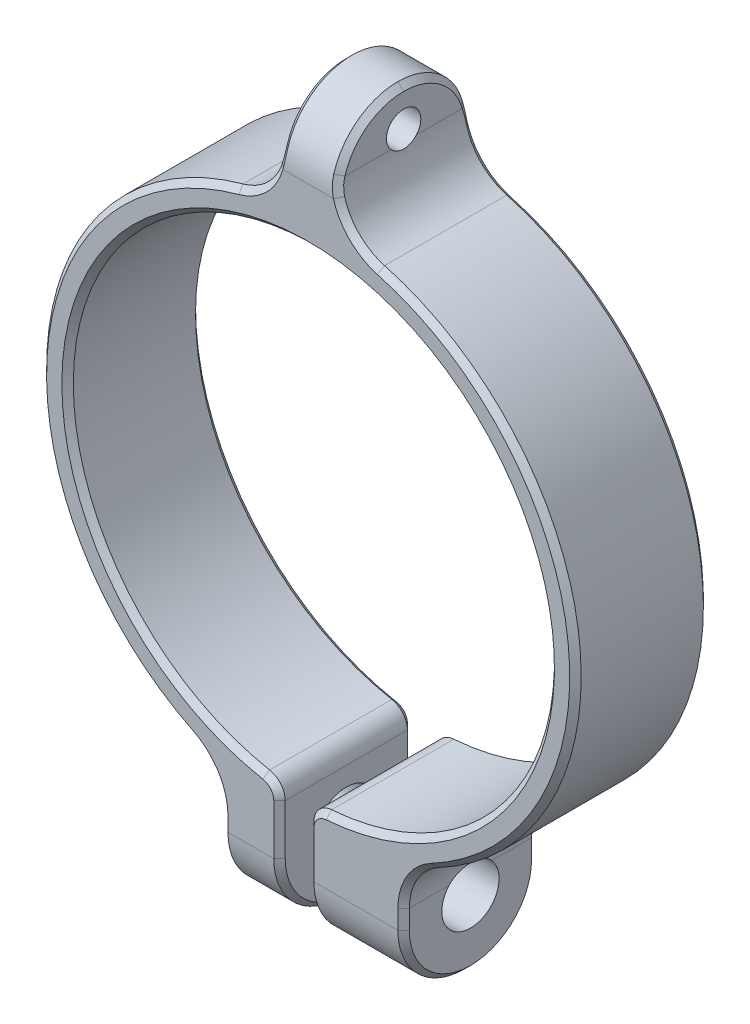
ISO-10303-21;
HEADER;
FILE_DESCRIPTION(('STEP AP214'),'2;1');
FILE_NAME('part.step','',(''),(''),'','','');
FILE_SCHEMA(('AUTOMOTIVE_DESIGN { 1 0 10303 214 1 1 1 1 }'));
ENDSEC;
DATA;
#1=APPLICATION_CONTEXT('core data for automotive mechanical design processes');
#2=APPLICATION_PROTOCOL_DEFINITION('international standard','automotive_design',2000,#1);
#3=PRODUCT_CONTEXT('',#1,'mechanical');
#4=PRODUCT('Part','Part','',(#3));
#5=PRODUCT_RELATED_PRODUCT_CATEGORY('part','',(#4));
#6=PRODUCT_DEFINITION_FORMATION('','',#4);
#7=PRODUCT_DEFINITION_CONTEXT('part definition',#1,'design');
#8=PRODUCT_DEFINITION('design','',#6,#7);
#9=PRODUCT_DEFINITION_SHAPE('','',#8);
#10=(LENGTH_UNIT() NAMED_UNIT(*) SI_UNIT(.MILLI.,.METRE.));
#11=(NAMED_UNIT(*) PLANE_ANGLE_UNIT() SI_UNIT($,.RADIAN.));
#12=(NAMED_UNIT(*) SI_UNIT($,.STERADIAN.) SOLID_ANGLE_UNIT());
#13=UNCERTAINTY_MEASURE_WITH_UNIT(LENGTH_MEASURE(1.E-05),#10,'distance_accuracy_value','');
#14=(GEOMETRIC_REPRESENTATION_CONTEXT(3) GLOBAL_UNCERTAINTY_ASSIGNED_CONTEXT((#13)) GLOBAL_UNIT_ASSIGNED_CONTEXT((#10,
#11,#12)) REPRESENTATION_CONTEXT('',''));
#15=CARTESIAN_POINT('',(0.,0.,0.));
#16=DIRECTION('',(0.,0.,1.));
#17=DIRECTION('',(1.,0.,0.));
#18=AXIS2_PLACEMENT_3D('',#15,#16,#17);
#19=CARTESIAN_POINT('',(14.,17.,3.5));
#20=DIRECTION('',(-1.,0.,0.));
#21=DIRECTION('',(0.,0.,1.));
#22=AXIS2_PLACEMENT_3D('',#19,#20,#21);
#23=CYLINDRICAL_SURFACE('',#22,0.900000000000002);
#24=CARTESIAN_POINT('',(1.5,17.,3.5));
#25=DIRECTION('',(-1.,0.,0.));
#26=DIRECTION('',(0.,0.,1.));
#27=AXIS2_PLACEMENT_3D('',#24,#25,#26);
#28=CIRCLE('',#27,0.900000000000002);
#29=CARTESIAN_POINT('',(1.5,16.393596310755,2.83496273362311));
#30=VERTEX_POINT('',#29);
#31=CARTESIAN_POINT('',(1.5,16.393596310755,4.1650372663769));
#32=VERTEX_POINT('',#31);
#33=EDGE_CURVE('E285',#30,#32,#28,.F.);
#34=ORIENTED_EDGE('',*,*,#33,.T.);
#35=CARTESIAN_POINT('',(1.5,16.393596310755,2.83496273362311));
#36=CARTESIAN_POINT('',(1.50000534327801,16.3562009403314,2.86900478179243));
#37=CARTESIAN_POINT('',(1.50070072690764,16.3217502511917,2.90623888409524));
#38=CARTESIAN_POINT('',(1.50283196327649,16.2595788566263,2.98589247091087));
#39=CARTESIAN_POINT('',(1.50426721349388,16.2318527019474,3.02830771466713));
#40=CARTESIAN_POINT('',(1.50724105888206,16.1839010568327,3.11719603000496));
#41=CARTESIAN_POINT('',(1.50877968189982,16.1636775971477,3.163670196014));
#42=CARTESIAN_POINT('',(1.51144395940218,16.1313009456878,3.25935334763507));
#43=CARTESIAN_POINT('',(1.51256967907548,16.1191464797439,3.30856190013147));
#44=CARTESIAN_POINT('',(1.51407278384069,16.1032455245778,3.4084013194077));
#45=CARTESIAN_POINT('',(1.51444914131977,16.0995105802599,3.45903404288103));
#46=CARTESIAN_POINT('',(1.51434280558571,16.1005922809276,3.56020886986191));
#47=CARTESIAN_POINT('',(1.51386008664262,16.1054091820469,3.61075097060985));
#48=CARTESIAN_POINT('',(1.51217760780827,16.1234158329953,3.71009044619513));
#49=CARTESIAN_POINT('',(1.51098080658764,16.1365710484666,3.75889414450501));
#50=CARTESIAN_POINT('',(1.50823197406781,16.1708463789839,3.85361237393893));
#51=CARTESIAN_POINT('',(1.50667993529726,16.1919666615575,3.89952684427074));
#52=CARTESIAN_POINT('',(1.50383576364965,16.2401483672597,3.98463695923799));
#53=CARTESIAN_POINT('',(1.50253378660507,16.2667951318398,4.02406767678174));
#54=CARTESIAN_POINT('',(1.50061747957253,16.3259617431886,4.09828110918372));
#55=CARTESIAN_POINT('',(1.50000337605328,16.3584835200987,4.13306228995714));
#56=CARTESIAN_POINT('',(1.5,16.393596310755,4.1650372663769));
#57=B_SPLINE_CURVE_WITH_KNOTS('',3,(#35,#36,#37,#38,#39,#40,#41,#42,#43,#44,#45,#46,#47,#48,#49,
#50,#51,#52,#53,#54,#55,#56),.UNSPECIFIED.,.F.,.F.,(4,2,2,2,2,2,2,2,2,2,4),(0.,0.15148641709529,
0.302849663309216,0.454253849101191,0.605634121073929,0.757221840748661,0.908814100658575,
1.05978258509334,1.21075424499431,1.352987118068,1.49526680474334),.UNSPECIFIED.);
#58=EDGE_CURVE('E290',#30,#32,#57,.T.);
#59=ORIENTED_EDGE('',*,*,#58,.F.);
#60=EDGE_LOOP('',(#34,#59));
#61=FACE_BOUND('',#60,.T.);
#62=CARTESIAN_POINT('',(-1.5,16.393596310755,4.1650372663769));
#63=CARTESIAN_POINT('',(-1.50000534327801,16.3562009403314,4.13099521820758));
#64=CARTESIAN_POINT('',(-1.50070072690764,16.3217502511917,4.09376111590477));
#65=CARTESIAN_POINT('',(-1.50283196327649,16.2595788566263,4.01410752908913));
#66=CARTESIAN_POINT('',(-1.50426721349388,16.2318527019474,3.97169228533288));
#67=CARTESIAN_POINT('',(-1.50724105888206,16.1839010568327,3.88280396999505));
#68=CARTESIAN_POINT('',(-1.50877968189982,16.1636775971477,3.836329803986));
#69=CARTESIAN_POINT('',(-1.51144395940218,16.1313009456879,3.74064665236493));
#70=CARTESIAN_POINT('',(-1.51256967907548,16.1191464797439,3.69143809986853));
#71=CARTESIAN_POINT('',(-1.51407278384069,16.1032455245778,3.5915986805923));
#72=CARTESIAN_POINT('',(-1.51444914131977,16.0995105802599,3.54096595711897));
#73=CARTESIAN_POINT('',(-1.51434280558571,16.1005922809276,3.43979113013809));
#74=CARTESIAN_POINT('',(-1.51386008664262,16.1054091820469,3.38924902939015));
#75=CARTESIAN_POINT('',(-1.51217760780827,16.1234158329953,3.28990955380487));
#76=CARTESIAN_POINT('',(-1.51098080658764,16.1365710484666,3.24110585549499));
#77=CARTESIAN_POINT('',(-1.50823197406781,16.1708463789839,3.14638762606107));
#78=CARTESIAN_POINT('',(-1.50667993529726,16.1919666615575,3.10047315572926));
#79=CARTESIAN_POINT('',(-1.50383576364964,16.2401483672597,3.01536304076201));
#80=CARTESIAN_POINT('',(-1.50253378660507,16.2667951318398,2.97593232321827));
#81=CARTESIAN_POINT('',(-1.50061747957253,16.3259617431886,2.90171889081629));
#82=CARTESIAN_POINT('',(-1.50000337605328,16.3584835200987,2.86693771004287));
#83=CARTESIAN_POINT('',(-1.5,16.393596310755,2.83496273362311));
#84=B_SPLINE_CURVE_WITH_KNOTS('',3,(#62,#63,#64,#65,#66,#67,#68,#69,#70,#71,#72,#73,#74,#75,#76,
#77,#78,#79,#80,#81,#82,#83),.UNSPECIFIED.,.F.,.F.,(4,2,2,2,2,2,2,2,2,2,4),(0.,
0.151486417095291,0.302849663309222,0.454253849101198,0.605634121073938,0.757221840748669,
0.908814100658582,1.05978258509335,1.21075424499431,1.35298711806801,1.49526680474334),.UNSPECIFIED.);
#85=CARTESIAN_POINT('',(-1.5,16.393596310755,4.1650372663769));
#86=VERTEX_POINT('',#85);
#87=CARTESIAN_POINT('',(-1.5,16.393596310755,2.83496273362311));
#88=VERTEX_POINT('',#87);
#89=EDGE_CURVE('E293',#86,#88,#84,.T.);
#90=ORIENTED_EDGE('',*,*,#89,.F.);
#91=CARTESIAN_POINT('',(-1.5,17.,3.5));
#92=DIRECTION('',(-1.,0.,0.));
#93=DIRECTION('',(0.,0.,1.));
#94=AXIS2_PLACEMENT_3D('',#91,#92,#93);
#95=CIRCLE('',#94,0.900000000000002);
#96=EDGE_CURVE('E292',#86,#88,#95,.T.);
#97=ORIENTED_EDGE('',*,*,#96,.T.);
#98=EDGE_LOOP('',(#90,#97));
#99=FACE_BOUND('',#98,.T.);
#100=ADVANCED_FACE('F17',(#61,#99),#23,.F.);
#101=CARTESIAN_POINT('',(1.5,19.,7.));
#102=DIRECTION('',(-1.,0.,0.));
#103=DIRECTION('',(0.,-1.,0.));
#104=AXIS2_PLACEMENT_3D('',#101,#102,#103);
#105=PLANE('',#104);
#106=CARTESIAN_POINT('',(1.50000000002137,15.5,3.5));
#107=DIRECTION('',(-1.,0.,0.));
#108=DIRECTION('',(0.,0.,1.));
#109=AXIS2_PLACEMENT_3D('',#106,#107,#108);
#110=CIRCLE('',#109,3.20000000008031);
#111=CARTESIAN_POINT('',(1.50000000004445,16.3935963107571,6.5727000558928));
#112=VERTEX_POINT('',#111);
#113=CARTESIAN_POINT('',(1.50000000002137,18.7000000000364,3.5));
#114=VERTEX_POINT('',#113);
#115=EDGE_CURVE('E299',#112,#114,#110,.T.);
#116=ORIENTED_EDGE('',*,*,#115,.F.);
#117=DIRECTION('',(0.,0.,-1.));
#118=VECTOR('',#117,1.);
#119=CARTESIAN_POINT('',(1.5,16.393596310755,7.));
#120=LINE('',#119,#118);
#121=EDGE_CURVE('E296',#112,#32,#120,.T.);
#122=ORIENTED_EDGE('',*,*,#121,.T.);
#123=ORIENTED_EDGE('',*,*,#33,.F.);
#124=DIRECTION('',(0.,0.,-1.));
#125=VECTOR('',#124,1.);
#126=CARTESIAN_POINT('',(1.5,16.393596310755,7.));
#127=LINE('',#126,#125);
#128=CARTESIAN_POINT('',(1.50000000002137,16.393596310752,0.427299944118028));
#129=VERTEX_POINT('',#128);
#130=EDGE_CURVE('E303',#30,#129,#127,.T.);
#131=ORIENTED_EDGE('',*,*,#130,.T.);
#132=CARTESIAN_POINT('',(1.50000000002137,15.5,3.5));
#133=DIRECTION('',(-1.,0.,0.));
#134=DIRECTION('',(0.,0.,1.));
#135=AXIS2_PLACEMENT_3D('',#132,#133,#134);
#136=CIRCLE('',#135,3.20000000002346);
#137=EDGE_CURVE('E380',#114,#129,#136,.T.);
#138=ORIENTED_EDGE('',*,*,#137,.F.);
#139=EDGE_LOOP('',(#116,#122,#123,#131,#138));
#140=FACE_BOUND('',#139,.T.);
#141=ADVANCED_FACE('F297',(#140),#105,.F.);
#142=CARTESIAN_POINT('',(-1.5,19.,7.));
#143=DIRECTION('',(1.,0.,0.));
#144=DIRECTION('',(0.,1.,0.));
#145=AXIS2_PLACEMENT_3D('',#142,#143,#144);
#146=PLANE('',#145);
#147=CARTESIAN_POINT('',(-1.49999999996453,15.5,3.5));
#148=DIRECTION('',(1.,0.,0.));
#149=DIRECTION('',(0.,0.,-1.));
#150=AXIS2_PLACEMENT_3D('',#147,#148,#149);
#151=CIRCLE('',#150,3.20000000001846);
#152=CARTESIAN_POINT('',(-1.49999999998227,16.3935963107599,0.427299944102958));
#153=VERTEX_POINT('',#152);
#154=CARTESIAN_POINT('',(-1.49999999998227,16.3935963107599,6.57270005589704));
#155=VERTEX_POINT('',#154);
#156=EDGE_CURVE('E1156',#153,#155,#151,.T.);
#157=ORIENTED_EDGE('',*,*,#156,.F.);
#158=DIRECTION('',(0.,0.,-1.));
#159=VECTOR('',#158,1.);
#160=CARTESIAN_POINT('',(-1.5,16.393596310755,7.));
#161=LINE('',#160,#159);
#162=EDGE_CURVE('E745',#153,#88,#161,.F.);
#163=ORIENTED_EDGE('',*,*,#162,.T.);
#164=ORIENTED_EDGE('',*,*,#96,.F.);
#165=DIRECTION('',(0.,0.,-1.));
#166=VECTOR('',#165,1.);
#167=CARTESIAN_POINT('',(-1.5,16.393596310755,7.));
#168=LINE('',#167,#166);
#169=EDGE_CURVE('E741',#86,#155,#168,.F.);
#170=ORIENTED_EDGE('',*,*,#169,.T.);
#171=EDGE_LOOP('',(#157,#163,#164,#170));
#172=FACE_BOUND('',#171,.T.);
#173=ADVANCED_FACE('F1239',(#172),#146,.F.);
#174=CARTESIAN_POINT('',(2.57106781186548,-16.,3.5));
#175=DIRECTION('',(-1.,0.,0.));
#176=DIRECTION('',(0.,0.,1.));
#177=AXIS2_PLACEMENT_3D('',#174,#175,#176);
#178=CYLINDRICAL_SURFACE('',#177,2.5);
#179=CARTESIAN_POINT('',(-4.5,-16.,3.5));
#180=DIRECTION('',(-1.,0.,0.));
#181=DIRECTION('',(0.,0.,1.));
#182=AXIS2_PLACEMENT_3D('',#179,#180,#181);
#183=CIRCLE('',#182,2.5);
#184=CARTESIAN_POINT('',(-4.5,-15.2561463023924,5.88677222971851));
#185=VERTEX_POINT('',#184);
#186=CARTESIAN_POINT('',(-4.5,-15.2561463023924,1.1132277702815));
#187=VERTEX_POINT('',#186);
#188=EDGE_CURVE('E384',#185,#187,#183,.T.);
#189=ORIENTED_EDGE('',*,*,#188,.F.);
#190=CARTESIAN_POINT('',(-4.5,-15.2561463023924,5.88677222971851));
#191=CARTESIAN_POINT('',(-4.49998754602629,-15.1944249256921,5.86755041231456));
#192=CARTESIAN_POINT('',(-4.50190415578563,-15.1334832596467,5.84591772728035));
#193=CARTESIAN_POINT('',(-4.50921523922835,-15.0136940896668,5.79811589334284));
#194=CARTESIAN_POINT('',(-4.51460592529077,-14.9548443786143,5.77195170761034));
#195=CARTESIAN_POINT('',(-4.52843377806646,-14.8400751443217,5.715544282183));
#196=CARTESIAN_POINT('',(-4.53684748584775,-14.7841367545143,5.68533354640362));
#197=CARTESIAN_POINT('',(-4.55629401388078,-14.6750544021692,5.62097466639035));
#198=CARTESIAN_POINT('',(-4.56732748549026,-14.6219111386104,5.58682554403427));
#199=CARTESIAN_POINT('',(-4.60358512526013,-14.4675400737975,5.47920091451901));
#200=CARTESIAN_POINT('',(-4.63204327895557,-14.3708009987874,5.40026516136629));
#201=CARTESIAN_POINT('',(-4.69392957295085,-14.1907440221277,5.22975242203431));
#202=CARTESIAN_POINT('',(-4.72737044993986,-14.107461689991,5.13814308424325));
#203=CARTESIAN_POINT('',(-4.799401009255,-13.9464039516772,4.93240029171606));
#204=CARTESIAN_POINT('',(-4.83813133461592,-13.8704497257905,4.8168841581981));
#205=CARTESIAN_POINT('',(-4.91127416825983,-13.7381801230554,4.57390404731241));
#206=CARTESIAN_POINT('',(-4.94569068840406,-13.6818464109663,4.44645136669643));
#207=CARTESIAN_POINT('',(-4.99958930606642,-13.5978199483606,4.2024677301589));
#208=CARTESIAN_POINT('',(-5.02056508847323,-13.567026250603,4.08734485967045));
#209=CARTESIAN_POINT('',(-5.05176080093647,-13.5221058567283,3.85253632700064));
#210=CARTESIAN_POINT('',(-5.0619958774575,-13.5079556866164,3.73285733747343));
#211=CARTESIAN_POINT('',(-5.06981387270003,-13.4970981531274,3.4918935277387));
#212=CARTESIAN_POINT('',(-5.06735701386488,-13.5004456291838,3.37060484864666));
#213=CARTESIAN_POINT('',(-5.05018705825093,-13.5244949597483,3.13061274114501));
#214=CARTESIAN_POINT('',(-5.03546411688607,-13.5452107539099,3.01191146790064));
#215=CARTESIAN_POINT('',(-4.99711292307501,-13.6018608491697,2.78430220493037));
#216=CARTESIAN_POINT('',(-4.97381129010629,-13.6372423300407,2.67519733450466));
#217=CARTESIAN_POINT('',(-4.92151431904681,-13.7219090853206,2.46401669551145));
#218=CARTESIAN_POINT('',(-4.89251688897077,-13.7711994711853,2.36194352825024));
#219=CARTESIAN_POINT('',(-4.82674551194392,-13.8925967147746,2.14853176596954));
#220=CARTESIAN_POINT('',(-4.78950352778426,-13.9671977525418,2.03875045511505));
#221=CARTESIAN_POINT('',(-4.71661909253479,-14.133184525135,1.8318755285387));
#222=CARTESIAN_POINT('',(-4.68097905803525,-14.2245946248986,1.73480068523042));
#223=CARTESIAN_POINT('',(-4.61300461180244,-14.43257992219,1.54691182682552));
#224=CARTESIAN_POINT('',(-4.58129993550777,-14.5507161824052,1.45755410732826));
#225=CARTESIAN_POINT('',(-4.54410974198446,-14.7395782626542,1.33971037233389));
#226=CARTESIAN_POINT('',(-4.53344755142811,-14.8043888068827,1.30316280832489));
#227=CARTESIAN_POINT('',(-4.51622705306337,-14.9374313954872,1.23582564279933));
#228=CARTESIAN_POINT('',(-4.50966453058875,-15.00565984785,1.2050301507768));
#229=CARTESIAN_POINT('',(-4.50366482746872,-15.1049358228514,1.16550089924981));
#230=CARTESIAN_POINT('',(-4.50229946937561,-15.1348890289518,1.15423604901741));
#231=CARTESIAN_POINT('',(-4.50046726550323,-15.1952136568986,1.13286219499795));
#232=CARTESIAN_POINT('',(-4.49999993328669,-15.2255848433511,1.12275256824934));
#233=CARTESIAN_POINT('',(-4.5,-15.2561463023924,1.1132277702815));
#234=B_SPLINE_CURVE_WITH_KNOTS('',3,(#190,#191,#192,#193,#194,#195,#196,#197,#198,#199,#200,
#201,#202,#203,#204,#205,#206,#207,#208,#209,#210,#211,#212,#213,#214,#215,#216,#217,#218,#219,
#220,#221,#222,#223,#224,#225,#226,#227,#228,#229,#230,#231,#232,#233),.UNSPECIFIED.,.F.,.F.,(4,
2,2,2,2,2,2,2,2,2,2,2,2,2,2,2,2,2,2,2,2,4),(0.,0.193817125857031,0.38742329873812,
0.579558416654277,0.771741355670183,1.15420795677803,1.5376695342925,1.96655821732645,
2.39504502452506,2.75653680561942,3.11751812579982,3.47963147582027,3.84203573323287,
4.1918690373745,4.54183107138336,4.95372876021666,5.36622827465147,5.81767117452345,
6.04284205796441,6.26778107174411,6.36384314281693,6.45985316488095),.UNSPECIFIED.);
#235=EDGE_CURVE('E724',#185,#187,#234,.T.);
#236=ORIENTED_EDGE('',*,*,#235,.T.);
#237=EDGE_LOOP('',(#189,#236));
#238=FACE_BOUND('',#237,.T.);
#239=ADVANCED_FACE('F1235',(#238),#178,.F.);
#240=CARTESIAN_POINT('',(-4.5,-12.5103956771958,7.));
#241=DIRECTION('',(-1.,0.,0.));
#242=DIRECTION('',(0.,-1.,0.));
#243=AXIS2_PLACEMENT_3D('',#240,#241,#242);
#244=PLANE('',#243);
#245=DIRECTION('',(0.,-1.,0.));
#246=VECTOR('',#245,1.);
#247=CARTESIAN_POINT('',(-4.5,-12.5103956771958,0.300000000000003));
#248=LINE('',#247,#246);
#249=CARTESIAN_POINT('',(-4.49999999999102,-15.2561463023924,0.299999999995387));
#250=VERTEX_POINT('',#249);
#251=CARTESIAN_POINT('',(-4.50000000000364,-16.,0.300000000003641));
#252=VERTEX_POINT('',#251);
#253=EDGE_CURVE('E386',#250,#252,#248,.T.);
#254=ORIENTED_EDGE('',*,*,#253,.T.);
#255=CARTESIAN_POINT('',(-4.50000000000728,-16.,3.5));
#256=DIRECTION('',(1.,0.,0.));
#257=DIRECTION('',(0.,0.,-1.));
#258=AXIS2_PLACEMENT_3D('',#255,#256,#257);
#259=CIRCLE('',#258,3.20000000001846);
#260=CARTESIAN_POINT('',(-4.50000000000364,-16.,6.69999999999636));
#261=VERTEX_POINT('',#260);
#262=EDGE_CURVE('E702',#261,#252,#259,.T.);
#263=ORIENTED_EDGE('',*,*,#262,.F.);
#264=DIRECTION('',(0.,-1.,0.));
#265=VECTOR('',#264,1.);
#266=CARTESIAN_POINT('',(-4.5,-12.5103956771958,6.7));
#267=LINE('',#266,#265);
#268=CARTESIAN_POINT('',(-4.50000000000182,-15.2561463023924,6.69999999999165));
#269=VERTEX_POINT('',#268);
#270=EDGE_CURVE('E387',#261,#269,#267,.F.);
#271=ORIENTED_EDGE('',*,*,#270,.T.);
#272=DIRECTION('',(0.,0.,-1.));
#273=VECTOR('',#272,1.);
#274=CARTESIAN_POINT('',(-4.5,-15.2561463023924,7.));
#275=LINE('',#274,#273);
#276=EDGE_CURVE('E703',#269,#185,#275,.T.);
#277=ORIENTED_EDGE('',*,*,#276,.T.);
#278=ORIENTED_EDGE('',*,*,#188,.T.);
#279=DIRECTION('',(0.,0.,-1.));
#280=VECTOR('',#279,1.);
#281=CARTESIAN_POINT('',(-4.5,-15.2561463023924,7.));
#282=LINE('',#281,#280);
#283=EDGE_CURVE('E721',#187,#250,#282,.T.);
#284=ORIENTED_EDGE('',*,*,#283,.T.);
#285=EDGE_LOOP('',(#254,#263,#271,#277,#278,#284));
#286=FACE_BOUND('',#285,.T.);
#287=CARTESIAN_POINT('',(-4.5,-16.,3.5));
#288=DIRECTION('',(-1.,0.,0.));
#289=DIRECTION('',(0.,-1.,0.));
#290=AXIS2_PLACEMENT_3D('',#287,#288,#289);
#291=CIRCLE('',#290,1.65);
#292=CARTESIAN_POINT('',(-4.5,-17.65,3.5));
#293=VERTEX_POINT('',#292);
#294=EDGE_CURVE('E374',#293,#293,#291,.F.);
#295=ORIENTED_EDGE('',*,*,#294,.T.);
#296=EDGE_LOOP('',(#295));
#297=FACE_BOUND('',#296,.T.);
#298=ADVANCED_FACE('F838',(#286,#297),#244,.T.);
#299=CARTESIAN_POINT('',(5.,-12.6,7.));
#300=DIRECTION('',(1.,0.,0.));
#301=DIRECTION('',(0.,1.,0.));
#302=AXIS2_PLACEMENT_3D('',#299,#300,#301);
#303=PLANE('',#302);
#304=CARTESIAN_POINT('',(5.,-16.,3.5));
#305=DIRECTION('',(-1.,0.,0.));
#306=DIRECTION('',(0.,0.,1.));
#307=AXIS2_PLACEMENT_3D('',#304,#305,#306);
#308=CIRCLE('',#307,1.49999999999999);
#309=CARTESIAN_POINT('',(5.,-15.,2.38196601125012));
#310=VERTEX_POINT('',#309);
#311=CARTESIAN_POINT('',(5.,-15.,4.61803398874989));
#312=VERTEX_POINT('',#311);
#313=EDGE_CURVE('E672',#310,#312,#308,.T.);
#314=ORIENTED_EDGE('',*,*,#313,.T.);
#315=DIRECTION('',(0.,0.,-1.));
#316=VECTOR('',#315,1.);
#317=CARTESIAN_POINT('',(5.,-15.,7.));
#318=LINE('',#317,#316);
#319=CARTESIAN_POINT('',(4.99999999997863,-15.,6.70000000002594));
#320=VERTEX_POINT('',#319);
#321=EDGE_CURVE('E774',#312,#320,#318,.F.);
#322=ORIENTED_EDGE('',*,*,#321,.T.);
#323=DIRECTION('',(0.,1.,0.));
#324=VECTOR('',#323,1.);
#325=CARTESIAN_POINT('',(5.,-12.6,6.7));
#326=LINE('',#325,#324);
#327=CARTESIAN_POINT('',(5.00000000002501,-16.,6.70000000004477));
#328=VERTEX_POINT('',#327);
#329=EDGE_CURVE('E832',#320,#328,#326,.F.);
#330=ORIENTED_EDGE('',*,*,#329,.T.);
#331=CARTESIAN_POINT('',(4.99999999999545,-16.,3.5));
#332=DIRECTION('',(-1.,0.,0.));
#333=DIRECTION('',(0.,0.,1.));
#334=AXIS2_PLACEMENT_3D('',#331,#332,#333);
#335=CIRCLE('',#334,3.20000000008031);
#336=CARTESIAN_POINT('',(4.99999999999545,-19.2000000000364,3.5));
#337=VERTEX_POINT('',#336);
#338=EDGE_CURVE('E369',#337,#328,#335,.T.);
#339=ORIENTED_EDGE('',*,*,#338,.F.);
#340=CARTESIAN_POINT('',(4.99999999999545,-16.,3.5));
#341=DIRECTION('',(-1.,0.,0.));
#342=DIRECTION('',(0.,0.,1.));
#343=AXIS2_PLACEMENT_3D('',#340,#341,#342);
#344=CIRCLE('',#343,3.20000000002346);
#345=CARTESIAN_POINT('',(4.99999999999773,-16.,0.29999999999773));
#346=VERTEX_POINT('',#345);
#347=EDGE_CURVE('E377',#346,#337,#344,.T.);
#348=ORIENTED_EDGE('',*,*,#347,.F.);
#349=DIRECTION('',(0.,1.,0.));
#350=VECTOR('',#349,1.);
#351=CARTESIAN_POINT('',(5.,-12.6,0.300000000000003));
#352=LINE('',#351,#350);
#353=CARTESIAN_POINT('',(4.99999999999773,-15.,0.29999999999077));
#354=VERTEX_POINT('',#353);
#355=EDGE_CURVE('E383',#346,#354,#352,.T.);
#356=ORIENTED_EDGE('',*,*,#355,.T.);
#357=DIRECTION('',(0.,0.,-1.));
#358=VECTOR('',#357,1.);
#359=CARTESIAN_POINT('',(5.,-15.,7.));
#360=LINE('',#359,#358);
#361=EDGE_CURVE('E786',#354,#310,#360,.F.);
#362=ORIENTED_EDGE('',*,*,#361,.T.);
#363=EDGE_LOOP('',(#314,#322,#330,#339,#348,#356,#362));
#364=FACE_BOUND('',#363,.T.);
#365=ADVANCED_FACE('F1129',(#364),#303,.T.);
#366=CARTESIAN_POINT('',(1.20000000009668,15.5,3.5));
#367=DIRECTION('',(-1.,0.,0.));
#368=DIRECTION('',(0.,0.,1.));
#369=AXIS2_PLACEMENT_3D('',#366,#367,#368);
#370=CONICAL_SURFACE('',#369,3.49999999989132,0.785398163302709);
#371=DIRECTION('',(0.707106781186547,-0.707106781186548,0.));
#372=VECTOR('',#371,1.);
#373=CARTESIAN_POINT('',(-498991.799999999,499012.,3.50000000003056));
#374=LINE('',#373,#372);
#375=CARTESIAN_POINT('',(1.20000000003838,18.9999999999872,3.5));
#376=VERTEX_POINT('',#375);
#377=EDGE_CURVE('E753',#114,#376,#374,.F.);
#378=ORIENTED_EDGE('',*,*,#377,.F.);
#379=ORIENTED_EDGE('',*,*,#137,.T.);
#380=DIRECTION('',(0.707106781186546,-0.197458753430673,0.678977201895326));
#381=VECTOR('',#380,1.);
#382=CARTESIAN_POINT('',(1.35,16.4354836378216,0.283267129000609));
#383=LINE('',#382,#381);
#384=CARTESIAN_POINT('',(1.2,16.4773709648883,0.139234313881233));
#385=VERTEX_POINT('',#384);
#386=EDGE_CURVE('E382',#385,#129,#383,.T.);
#387=ORIENTED_EDGE('',*,*,#386,.F.);
#388=CARTESIAN_POINT('',(1.2,15.5,3.5));
#389=DIRECTION('',(-1.,0.,0.));
#390=DIRECTION('',(0.,0.,1.));
#391=AXIS2_PLACEMENT_3D('',#388,#389,#390);
#392=CIRCLE('',#391,3.5);
#393=EDGE_CURVE('E645',#376,#385,#392,.T.);
#394=ORIENTED_EDGE('',*,*,#393,.F.);
#395=EDGE_LOOP('',(#378,#379,#387,#394));
#396=FACE_BOUND('',#395,.T.);
#397=ADVANCED_FACE('F337',(#396),#370,.T.);
#398=CARTESIAN_POINT('',(1.61499872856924,15.5820565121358,0.303030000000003));
#399=CARTESIAN_POINT('',(1.57694351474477,15.7172399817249,0.303039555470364));
#400=CARTESIAN_POINT('',(1.54907116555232,15.8524902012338,0.313382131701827));
#401=CARTESIAN_POINT('',(1.51211241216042,16.1228217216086,0.355387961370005));
#402=CARTESIAN_POINT('',(1.50303774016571,16.2579062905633,0.38703842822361));
#403=CARTESIAN_POINT('',(1.50303,16.3927501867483,0.430209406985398));
#404=CARTESIAN_POINT('',(1.61208193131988,15.5812360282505,0.300000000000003));
#405=CARTESIAN_POINT('',(1.57398824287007,15.716697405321,0.300009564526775));
#406=CARTESIAN_POINT('',(1.54608771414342,15.8522256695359,0.310361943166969));
#407=CARTESIAN_POINT('',(1.50909159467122,16.1231129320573,0.352407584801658));
#408=CARTESIAN_POINT('',(1.50000774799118,16.2584752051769,0.384088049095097));
#409=CARTESIAN_POINT('',(1.5,16.393596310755,0.427299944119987));
#410=CARTESIAN_POINT('',(1.32329012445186,15.5,0.));
#411=CARTESIAN_POINT('',(1.28138706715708,15.662976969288,1.04612011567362E-05));
#412=CARTESIAN_POINT('',(1.25069648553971,15.8260344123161,0.0113333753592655));
#413=CARTESIAN_POINT('',(1.21000075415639,16.1519456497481,0.0573207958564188));
#414=CARTESIAN_POINT('',(1.2000085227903,16.3148033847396,0.0919713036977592));
#415=CARTESIAN_POINT('',(1.2,16.4773709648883,0.139234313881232));
#416=CARTESIAN_POINT('',(1.32040220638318,15.4991876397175,-0.00300000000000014));
#417=CARTESIAN_POINT('',(1.27846105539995,15.6624397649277,-0.00298952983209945));
#418=CARTESIAN_POINT('',(1.24774257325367,15.8257724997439,0.00834308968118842));
#419=CARTESIAN_POINT('',(1.20700984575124,16.152233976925,0.0543699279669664));
#420=CARTESIAN_POINT('',(1.19700853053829,16.3153666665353,0.0890501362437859));
#421=CARTESIAN_POINT('',(1.197,16.4782087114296,0.136353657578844));
#422=B_SPLINE_SURFACE_WITH_KNOTS('',1,3,((#398,#399,#400,#401,#402,#403),(#404,#405,#406,#407,
#408,#409),(#410,#411,#412,#413,#414,#415),(#416,#417,#418,#419,#420,#421)),.UNSPECIFIED.,.F.,
.F.,.F.,(2,1,1,2),(4,2,4),(-0.0101,0.,1.,1.01),(0.,0.000455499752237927,0.000910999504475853),.UNSPECIFIED.);
#423=CARTESIAN_POINT('',(1.5,16.393596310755,0.427299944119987));
#424=CARTESIAN_POINT('',(1.49999864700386,16.359523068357,0.416399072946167));
#425=CARTESIAN_POINT('',(1.50058050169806,16.325232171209,0.406174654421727));
#426=CARTESIAN_POINT('',(1.5029447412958,16.2563139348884,0.387108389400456));
#427=CARTESIAN_POINT('',(1.50472697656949,16.2216866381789,0.378266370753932));
#428=CARTESIAN_POINT('',(1.50952627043,16.1521830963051,0.361991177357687));
#429=CARTESIAN_POINT('',(1.51254342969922,16.1173068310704,0.354558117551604));
#430=CARTESIAN_POINT('',(1.51983357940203,16.0474102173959,0.341112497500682));
#431=CARTESIAN_POINT('',(1.52410672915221,16.0123898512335,0.335100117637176));
#432=CARTESIAN_POINT('',(1.53830838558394,15.9110497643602,0.319782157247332));
#433=CARTESIAN_POINT('',(1.54988201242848,15.8446670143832,0.312320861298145));
#434=CARTESIAN_POINT('',(1.57757649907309,15.7123806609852,0.302412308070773));
#435=CARTESIAN_POINT('',(1.5937036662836,15.6464778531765,0.299972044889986));
#436=CARTESIAN_POINT('',(1.61208193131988,15.5812360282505,0.300000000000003));
#437=B_SPLINE_CURVE_WITH_KNOTS('',3,(#423,#424,#425,#426,#427,#428,#429,#430,#431,#432,#433,
#434,#435,#436),.UNSPECIFIED.,.F.,.F.,(4,2,2,2,2,2,4),(0.,0.107313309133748,0.214613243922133,
0.321921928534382,0.429244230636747,0.632268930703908,0.835576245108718),.UNSPECIFIED.);
#438=CARTESIAN_POINT('',(1.6120819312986,15.581236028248,0.300000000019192));
#439=VERTEX_POINT('',#438);
#440=EDGE_CURVE('E357',#129,#439,#437,.T.);
#441=DIRECTION('',(0.680688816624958,0.191475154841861,0.707106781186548));
#442=VECTOR('',#441,1.);
#443=CARTESIAN_POINT('',(-480355.715467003,-135107.093656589,-499000.));
#444=LINE('',#443,#442);
#445=CARTESIAN_POINT('',(1.32329012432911,15.4999999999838,-1.4210854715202E-11));
#446=VERTEX_POINT('',#445);
#447=EDGE_CURVE('E650',#439,#446,#444,.F.);
#448=CARTESIAN_POINT('',(1.2,16.4773709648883,0.139234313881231));
#449=CARTESIAN_POINT('',(1.19999038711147,16.409178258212,0.119389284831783));
#450=CARTESIAN_POINT('',(1.20176805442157,16.3403605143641,0.101639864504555));
#451=CARTESIAN_POINT('',(1.20901226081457,16.2020002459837,0.0703938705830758));
#452=CARTESIAN_POINT('',(1.2144766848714,16.1324581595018,0.056894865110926));
#453=CARTESIAN_POINT('',(1.22678403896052,16.0160301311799,0.0379252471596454));
#454=CARTESIAN_POINT('',(1.23258127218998,15.9692208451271,0.0312745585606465));
#455=CARTESIAN_POINT('',(1.24589885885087,15.8756165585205,0.0198946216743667));
#456=CARTESIAN_POINT('',(1.25341903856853,15.8288215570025,0.0151651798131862));
#457=CARTESIAN_POINT('',(1.27028788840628,15.7348330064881,0.00756502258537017));
#458=CARTESIAN_POINT('',(1.27965724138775,15.6876413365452,0.00471708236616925));
#459=CARTESIAN_POINT('',(1.30015625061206,15.5935578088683,0.000933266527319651));
#460=CARTESIAN_POINT('',(1.31128614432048,15.5466659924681,-2.3509167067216E-06));
#461=CARTESIAN_POINT('',(1.32329012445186,15.5,0.));
#462=B_SPLINE_CURVE_WITH_KNOTS('',3,(#448,#449,#450,#451,#452,#453,#454,#455,#456,#457,#458,
#459,#460,#461),.UNSPECIFIED.,.F.,.F.,(4,2,2,2,2,2,4),(0.,0.21303608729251,0.425950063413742,
0.568785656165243,0.711606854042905,0.856126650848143,1.00066595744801),.UNSPECIFIED.);
#463=EDGE_CURVE('E349',#385,#446,#462,.T.);
#464=ORIENTED_EDGE('',*,*,#386,.T.);
#465=ORIENTED_EDGE('',*,*,#440,.T.);
#466=ORIENTED_EDGE('',*,*,#447,.T.);
#467=ORIENTED_EDGE('',*,*,#463,.F.);
#468=EDGE_LOOP('',(#464,#465,#466,#467));
#469=FACE_BOUND('',#468,.T.);
#470=ADVANCED_FACE('F329',(#469),#422,.T.);
#471=CARTESIAN_POINT('',(-1.50303,16.3927501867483,0.430209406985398));
#472=CARTESIAN_POINT('',(-1.50303774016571,16.2579062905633,0.38703842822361));
#473=CARTESIAN_POINT('',(-1.51211241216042,16.1228217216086,0.355387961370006));
#474=CARTESIAN_POINT('',(-1.54907116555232,15.8524902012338,0.313382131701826));
#475=CARTESIAN_POINT('',(-1.57694351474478,15.7172399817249,0.303039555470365));
#476=CARTESIAN_POINT('',(-1.61499872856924,15.5820565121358,0.303030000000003));
#477=CARTESIAN_POINT('',(-1.5,16.393596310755,0.427299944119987));
#478=CARTESIAN_POINT('',(-1.50000774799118,16.2584752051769,0.384088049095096));
#479=CARTESIAN_POINT('',(-1.50909159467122,16.1231129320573,0.352407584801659));
#480=CARTESIAN_POINT('',(-1.54608771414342,15.8522256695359,0.310361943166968));
#481=CARTESIAN_POINT('',(-1.57398824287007,15.716697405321,0.300009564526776));
#482=CARTESIAN_POINT('',(-1.61208193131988,15.5812360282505,0.300000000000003));
#483=CARTESIAN_POINT('',(-1.2,16.4773709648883,0.139234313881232));
#484=CARTESIAN_POINT('',(-1.2000085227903,16.3148033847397,0.0919713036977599));
#485=CARTESIAN_POINT('',(-1.2100007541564,16.1519456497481,0.0573207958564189));
#486=CARTESIAN_POINT('',(-1.25069648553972,15.8260344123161,0.0113333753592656));
#487=CARTESIAN_POINT('',(-1.28138706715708,15.662976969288,1.04612011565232E-05));
#488=CARTESIAN_POINT('',(-1.32329012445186,15.5,0.));
#489=CARTESIAN_POINT('',(-1.197,16.4782087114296,0.136353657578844));
#490=CARTESIAN_POINT('',(-1.19700853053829,16.3153666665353,0.0890501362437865));
#491=CARTESIAN_POINT('',(-1.20700984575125,16.152233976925,0.0543699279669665));
#492=CARTESIAN_POINT('',(-1.24774257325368,15.8257724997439,0.00834308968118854));
#493=CARTESIAN_POINT('',(-1.27846105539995,15.6624397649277,-0.00298952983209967));
#494=CARTESIAN_POINT('',(-1.32040220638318,15.4991876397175,-0.00300000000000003));
#495=B_SPLINE_SURFACE_WITH_KNOTS('',1,3,((#471,#472,#473,#474,#475,#476),(#477,#478,#479,#480,
#481,#482),(#483,#484,#485,#486,#487,#488),(#489,#490,#491,#492,#493,#494)),.UNSPECIFIED.,.F.,
.F.,.F.,(2,1,1,2),(4,2,4),(-0.0101,0.,1.,1.01),(0.,0.000455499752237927,0.000910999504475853),.UNSPECIFIED.);
#496=DIRECTION('',(0.707106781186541,0.197458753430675,-0.678977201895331));
#497=VECTOR('',#496,1.);
#498=CARTESIAN_POINT('',(-1.35,16.4354836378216,0.283267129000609));
#499=LINE('',#498,#497);
#500=CARTESIAN_POINT('',(-1.2,16.4773709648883,0.139234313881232));
#501=VERTEX_POINT('',#500);
#502=EDGE_CURVE('E379',#153,#501,#499,.T.);
#503=CARTESIAN_POINT('',(-1.32329012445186,15.5,0.));
#504=CARTESIAN_POINT('',(-1.30558670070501,15.5687863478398,-1.29230998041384E-05));
#505=CARTESIAN_POINT('',(-1.28979377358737,15.6380774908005,0.00202725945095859));
#506=CARTESIAN_POINT('',(-1.26204974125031,15.7771310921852,0.0102977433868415));
#507=CARTESIAN_POINT('',(-1.25009622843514,15.8468932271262,0.016525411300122));
#508=CARTESIAN_POINT('',(-1.23333209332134,15.9634722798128,0.030501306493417));
#509=CARTESIAN_POINT('',(-1.22746543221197,16.0102834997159,0.0370743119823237));
#510=CARTESIAN_POINT('',(-1.21744316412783,16.1037769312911,0.0521464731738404));
#511=CARTESIAN_POINT('',(-1.21328741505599,16.1504591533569,0.0606454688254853));
#512=CARTESIAN_POINT('',(-1.20661733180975,16.2441028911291,0.0796754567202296));
#513=CARTESIAN_POINT('',(-1.20412299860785,16.2910611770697,0.0902292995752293));
#514=CARTESIAN_POINT('',(-1.20081282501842,16.3845634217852,0.113280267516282));
#515=CARTESIAN_POINT('',(-1.19999715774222,16.4311073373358,0.125777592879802));
#516=CARTESIAN_POINT('',(-1.2,16.4773709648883,0.139234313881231));
#517=B_SPLINE_CURVE_WITH_KNOTS('',3,(#503,#504,#505,#506,#507,#508,#509,#510,#511,#512,#513,
#514,#515,#516),.UNSPECIFIED.,.F.,.F.,(4,2,2,2,2,2,4),(0.,0.21305112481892,0.425968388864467,
0.568802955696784,0.711625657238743,0.856138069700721,1.00066538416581),.UNSPECIFIED.);
#518=CARTESIAN_POINT('',(-1.32329012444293,15.4999999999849,-3.94237593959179E-11));
#519=VERTEX_POINT('',#518);
#520=EDGE_CURVE('E555',#519,#501,#517,.T.);
#521=DIRECTION('',(-0.680688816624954,0.191475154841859,0.707106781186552));
#522=VECTOR('',#521,1.);
#523=CARTESIAN_POINT('',(480348.206880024,-135104.981519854,-498992.200000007));
#524=LINE('',#523,#522);
#525=CARTESIAN_POINT('',(-1.61208193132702,15.581236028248,0.29999999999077));
#526=VERTEX_POINT('',#525);
#527=EDGE_CURVE('E561',#519,#526,#524,.T.);
#528=CARTESIAN_POINT('',(-1.61208193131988,15.5812360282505,0.300000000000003));
#529=CARTESIAN_POINT('',(-1.60239240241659,15.6156761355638,0.299998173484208));
#530=CARTESIAN_POINT('',(-1.59332181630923,15.6502911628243,0.300672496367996));
#531=CARTESIAN_POINT('',(-1.57643586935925,15.7197654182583,0.303401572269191));
#532=CARTESIAN_POINT('',(-1.56862028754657,15.7546246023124,0.305456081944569));
#533=CARTESIAN_POINT('',(-1.55425778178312,15.8244960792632,0.310973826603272));
#534=CARTESIAN_POINT('',(-1.54771094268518,15.8595083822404,0.314437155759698));
#535=CARTESIAN_POINT('',(-1.53588898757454,15.9295809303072,0.322786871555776));
#536=CARTESIAN_POINT('',(-1.53061407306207,15.9646411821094,0.327673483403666));
#537=CARTESIAN_POINT('',(-1.51719787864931,16.0659541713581,0.343876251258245));
#538=CARTESIAN_POINT('',(-1.5106951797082,16.1321424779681,0.357040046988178));
#539=CARTESIAN_POINT('',(-1.50208172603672,16.2636938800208,0.388410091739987));
#540=CARTESIAN_POINT('',(-1.49997653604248,16.3290558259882,0.406622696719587));
#541=CARTESIAN_POINT('',(-1.5,16.393596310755,0.427299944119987));
#542=B_SPLINE_CURVE_WITH_KNOTS('',3,(#528,#529,#530,#531,#532,#533,#534,#535,#536,#537,#538,
#539,#540,#541),.UNSPECIFIED.,.F.,.F.,(4,2,2,2,2,2,4),(0.,0.107320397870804,0.214621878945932,
0.321930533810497,0.429256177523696,0.63228872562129,0.835578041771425),.UNSPECIFIED.);
#543=EDGE_CURVE('E747',#526,#153,#542,.T.);
#544=ORIENTED_EDGE('',*,*,#502,.T.);
#545=ORIENTED_EDGE('',*,*,#520,.F.);
#546=ORIENTED_EDGE('',*,*,#527,.T.);
#547=ORIENTED_EDGE('',*,*,#543,.T.);
#548=EDGE_LOOP('',(#544,#545,#546,#547));
#549=FACE_BOUND('',#548,.T.);
#550=ADVANCED_FACE('F336',(#549),#495,.T.);
#551=CARTESIAN_POINT('',(4.70000000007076,-16.,3.5));
#552=DIRECTION('',(-1.,0.,0.));
#553=DIRECTION('',(0.,0.,1.));
#554=AXIS2_PLACEMENT_3D('',#551,#552,#553);
#555=CONICAL_SURFACE('',#554,3.500000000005,0.785398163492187);
#556=DIRECTION('',(0.707106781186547,0.707106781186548,0.));
#557=VECTOR('',#556,1.);
#558=CARTESIAN_POINT('',(-498988.299999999,-499012.5,3.49999999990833));
#559=LINE('',#558,#557);
#560=CARTESIAN_POINT('',(4.7000000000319,-19.4999999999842,3.5));
#561=VERTEX_POINT('',#560);
#562=EDGE_CURVE('E373',#561,#337,#559,.T.);
#563=ORIENTED_EDGE('',*,*,#562,.F.);
#564=CARTESIAN_POINT('',(4.7,-16.,3.5));
#565=DIRECTION('',(1.,0.,0.));
#566=DIRECTION('',(0.,0.,-1.));
#567=AXIS2_PLACEMENT_3D('',#564,#565,#566);
#568=CIRCLE('',#567,3.5);
#569=CARTESIAN_POINT('',(4.7,-16.,0.));
#570=VERTEX_POINT('',#569);
#571=EDGE_CURVE('E565',#570,#561,#568,.F.);
#572=ORIENTED_EDGE('',*,*,#571,.F.);
#573=DIRECTION('',(-0.707106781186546,0.,-0.707106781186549));
#574=VECTOR('',#573,1.);
#575=CARTESIAN_POINT('',(4.7,-16.,0.));
#576=LINE('',#575,#574);
#577=EDGE_CURVE('E668',#346,#570,#576,.T.);
#578=ORIENTED_EDGE('',*,*,#577,.F.);
#579=ORIENTED_EDGE('',*,*,#347,.T.);
#580=EDGE_LOOP('',(#563,#572,#578,#579));
#581=FACE_BOUND('',#580,.T.);
#582=ADVANCED_FACE('F1126',(#581),#555,.T.);
#583=CARTESIAN_POINT('',(3.16690475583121,-16.,3.5));
#584=DIRECTION('',(-1.,0.,0.));
#585=DIRECTION('',(0.,-1.,0.));
#586=AXIS2_PLACEMENT_3D('',#583,#584,#585);
#587=CYLINDRICAL_SURFACE('',#586,1.65);
#588=ORIENTED_EDGE('',*,*,#294,.F.);
#589=EDGE_LOOP('',(#588));
#590=FACE_BOUND('',#589,.T.);
#591=CARTESIAN_POINT('',(-1.5,-16.,3.5));
#592=DIRECTION('',(-1.,0.,0.));
#593=DIRECTION('',(0.,-1.,0.));
#594=AXIS2_PLACEMENT_3D('',#591,#592,#593);
#595=CIRCLE('',#594,1.65);
#596=CARTESIAN_POINT('',(-1.5,-17.65,3.5));
#597=VERTEX_POINT('',#596);
#598=EDGE_CURVE('E562',#597,#597,#595,.T.);
#599=ORIENTED_EDGE('',*,*,#598,.F.);
#600=EDGE_LOOP('',(#599));
#601=FACE_BOUND('',#600,.T.);
#602=ADVANCED_FACE('F1309',(#590,#601),#587,.F.);
#603=CARTESIAN_POINT('',(4.70000000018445,-16.,3.5));
#604=DIRECTION('',(-1.,0.,0.));
#605=DIRECTION('',(0.,0.,1.));
#606=AXIS2_PLACEMENT_3D('',#603,#604,#605);
#607=CONICAL_SURFACE('',#606,3.49999999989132,0.785398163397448);
#608=DIRECTION('',(0.707106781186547,0.,-0.707106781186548));
#609=VECTOR('',#608,1.);
#610=CARTESIAN_POINT('',(-498988.299999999,-16.,499000.));
#611=LINE('',#610,#609);
#612=CARTESIAN_POINT('',(4.70000000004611,-16.,6.99999999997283));
#613=VERTEX_POINT('',#612);
#614=EDGE_CURVE('E372',#328,#613,#611,.F.);
#615=ORIENTED_EDGE('',*,*,#614,.T.);
#616=CARTESIAN_POINT('',(4.7,-16.,3.5));
#617=DIRECTION('',(-1.,0.,0.));
#618=DIRECTION('',(0.,0.,1.));
#619=AXIS2_PLACEMENT_3D('',#616,#617,#618);
#620=CIRCLE('',#619,3.5);
#621=EDGE_CURVE('E781',#561,#613,#620,.T.);
#622=ORIENTED_EDGE('',*,*,#621,.F.);
#623=ORIENTED_EDGE('',*,*,#562,.T.);
#624=ORIENTED_EDGE('',*,*,#338,.T.);
#625=EDGE_LOOP('',(#615,#622,#623,#624));
#626=FACE_BOUND('',#625,.T.);
#627=ADVANCED_FACE('F1044',(#626),#607,.T.);
#628=CARTESIAN_POINT('',(8.,-15.,7.));
#629=DIRECTION('',(0.,0.,-1.));
#630=DIRECTION('',(-1.,0.,0.));
#631=AXIS2_PLACEMENT_3D('',#628,#629,#630);
#632=CYLINDRICAL_SURFACE('',#631,3.);
#633=CARTESIAN_POINT('',(8.,-15.,6.70000000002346));
#634=DIRECTION('',(0.,0.,1.));
#635=DIRECTION('',(1.,0.,0.));
#636=AXIS2_PLACEMENT_3D('',#633,#634,#635);
#637=CIRCLE('',#636,3.0000000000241);
#638=CARTESIAN_POINT('',(6.58823529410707,-12.3529411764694,6.70000000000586));
#639=VERTEX_POINT('',#638);
#640=EDGE_CURVE('E777',#639,#320,#637,.T.);
#641=ORIENTED_EDGE('',*,*,#640,.T.);
#642=ORIENTED_EDGE('',*,*,#321,.F.);
#643=CARTESIAN_POINT('',(5.,-15.,4.61803398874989));
#644=CARTESIAN_POINT('',(4.99999976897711,-14.968666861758,4.59000917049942));
#645=CARTESIAN_POINT('',(5.00049084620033,-14.938531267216,4.56068249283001));
#646=CARTESIAN_POINT('',(5.00222861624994,-14.8808416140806,4.49962461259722));
#647=CARTESIAN_POINT('',(5.00347512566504,-14.8532869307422,4.46789399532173));
#648=CARTESIAN_POINT('',(5.00800294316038,-14.7748377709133,4.36948133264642));
#649=CARTESIAN_POINT('',(5.01207403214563,-14.7280541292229,4.29948517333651));
#650=CARTESIAN_POINT('',(5.02057556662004,-14.6468625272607,4.15273293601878));
#651=CARTESIAN_POINT('',(5.02500596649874,-14.6124529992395,4.07597771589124));
#652=CARTESIAN_POINT('',(5.03276863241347,-14.5569103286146,3.91775063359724));
#653=CARTESIAN_POINT('',(5.03610110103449,-14.5357747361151,3.83627964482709));
#654=CARTESIAN_POINT('',(5.0406922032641,-14.5073436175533,3.67052511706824));
#655=CARTESIAN_POINT('',(5.04194163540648,-14.5001094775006,3.58623076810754));
#656=CARTESIAN_POINT('',(5.04197816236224,-14.4998930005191,3.41762515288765));
#657=CARTESIAN_POINT('',(5.04076533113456,-14.5069102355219,3.33331388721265));
#658=CARTESIAN_POINT('',(5.03625538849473,-14.5348013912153,3.16815728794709));
#659=CARTESIAN_POINT('',(5.03298431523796,-14.5555023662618,3.0872819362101));
#660=CARTESIAN_POINT('',(5.02533430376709,-14.6099783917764,2.9301191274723));
#661=CARTESIAN_POINT('',(5.02095513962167,-14.6437561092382,2.85383261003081));
#662=CARTESIAN_POINT('',(5.01239844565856,-14.7244757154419,2.70609805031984));
#663=CARTESIAN_POINT('',(5.00822827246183,-14.771713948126,2.63480996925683));
#664=CARTESIAN_POINT('',(5.00357878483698,-14.8511276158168,2.53464054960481));
#665=CARTESIAN_POINT('',(5.00229613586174,-14.8790552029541,2.5023506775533));
#666=CARTESIAN_POINT('',(5.0005065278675,-14.9375760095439,2.44024786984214));
#667=CARTESIAN_POINT('',(4.99999974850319,-14.9681698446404,2.41043550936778));
#668=CARTESIAN_POINT('',(5.,-15.,2.38196601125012));
#669=B_SPLINE_CURVE_WITH_KNOTS('',3,(#643,#644,#645,#646,#647,#648,#649,#650,#651,#652,#653,
#654,#655,#656,#657,#658,#659,#660,#661,#662,#663,#664,#665,#666,#667,#668),.UNSPECIFIED.,.F.,
.F.,(4,2,2,2,2,2,2,2,2,2,2,2,4),(0.,0.126026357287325,0.252022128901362,0.503599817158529,
0.755145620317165,1.00664498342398,1.25925238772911,1.51185220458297,1.76131899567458,
2.01083669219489,2.26633978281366,2.3943323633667,2.52235457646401),.UNSPECIFIED.);
#670=EDGE_CURVE('E1208',#312,#310,#669,.T.);
#671=ORIENTED_EDGE('',*,*,#670,.T.);
#672=ORIENTED_EDGE('',*,*,#361,.F.);
#673=CARTESIAN_POINT('',(8.,-15.,0.299999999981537));
#674=DIRECTION('',(0.,0.,-1.));
#675=DIRECTION('',(-1.,0.,0.));
#676=AXIS2_PLACEMENT_3D('',#673,#674,#675);
#677=CIRCLE('',#676,3.00000000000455);
#678=CARTESIAN_POINT('',(6.58823529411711,-12.3529411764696,0.299999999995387));
#679=VERTEX_POINT('',#678);
#680=EDGE_CURVE('E662',#354,#679,#677,.T.);
#681=ORIENTED_EDGE('',*,*,#680,.T.);
#682=DIRECTION('',(0.,0.,-1.));
#683=VECTOR('',#682,1.);
#684=CARTESIAN_POINT('',(6.58823529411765,-12.3529411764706,7.));
#685=LINE('',#684,#683);
#686=EDGE_CURVE('E304',#639,#679,#685,.T.);
#687=ORIENTED_EDGE('',*,*,#686,.F.);
#688=EDGE_LOOP('',(#641,#642,#671,#672,#681,#687));
#689=FACE_BOUND('',#688,.T.);
#690=ADVANCED_FACE('F1135',(#689),#632,.F.);
#691=CARTESIAN_POINT('',(0.,0.,7.));
#692=DIRECTION('',(0.,0.,-1.));
#693=DIRECTION('',(-1.,0.,0.));
#694=AXIS2_PLACEMENT_3D('',#691,#692,#693);
#695=CYLINDRICAL_SURFACE('',#694,14.);
#696=ORIENTED_EDGE('',*,*,#686,.T.);
#697=CARTESIAN_POINT('',(0.,0.,0.300000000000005));
#698=DIRECTION('',(0.,0.,1.));
#699=DIRECTION('',(1.,0.,0.));
#700=AXIS2_PLACEMENT_3D('',#697,#698,#699);
#701=CIRCLE('',#700,14.);
#702=CARTESIAN_POINT('',(3.70588235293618,13.5006087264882,0.300000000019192));
#703=VERTEX_POINT('',#702);
#704=EDGE_CURVE('E661',#703,#679,#701,.F.);
#705=ORIENTED_EDGE('',*,*,#704,.F.);
#706=DIRECTION('',(0.,0.,-1.));
#707=VECTOR('',#706,1.);
#708=CARTESIAN_POINT('',(3.70588235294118,13.5006087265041,7.));
#709=LINE('',#708,#707);
#710=CARTESIAN_POINT('',(3.70588235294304,13.5006087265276,6.70000000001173));
#711=VERTEX_POINT('',#710);
#712=EDGE_CURVE('E363',#703,#711,#709,.F.);
#713=ORIENTED_EDGE('',*,*,#712,.T.);
#714=CARTESIAN_POINT('',(0.,0.,6.7));
#715=DIRECTION('',(0.,0.,-1.));
#716=DIRECTION('',(-1.,0.,0.));
#717=AXIS2_PLACEMENT_3D('',#714,#715,#716);
#718=CIRCLE('',#717,14.);
#719=EDGE_CURVE('E760',#639,#711,#718,.F.);
#720=ORIENTED_EDGE('',*,*,#719,.F.);
#721=EDGE_LOOP('',(#696,#705,#713,#720));
#722=FACE_BOUND('',#721,.T.);
#723=ADVANCED_FACE('F1140',(#722),#695,.T.);
#724=CARTESIAN_POINT('',(4.5,16.393596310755,7.));
#725=DIRECTION('',(0.,0.,-1.));
#726=DIRECTION('',(-1.,0.,0.));
#727=AXIS2_PLACEMENT_3D('',#724,#725,#726);
#728=CYLINDRICAL_SURFACE('',#727,3.);
#729=CARTESIAN_POINT('',(4.5,16.393596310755,6.70000000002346));
#730=DIRECTION('',(0.,0.,1.));
#731=DIRECTION('',(1.,0.,0.));
#732=AXIS2_PLACEMENT_3D('',#729,#730,#731);
#733=CIRCLE('',#732,2.99999999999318);
#734=CARTESIAN_POINT('',(1.6120819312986,15.5812360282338,6.70000000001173));
#735=VERTEX_POINT('',#734);
#736=EDGE_CURVE('E757',#735,#711,#733,.T.);
#737=ORIENTED_EDGE('',*,*,#736,.T.);
#738=ORIENTED_EDGE('',*,*,#712,.F.);
#739=CARTESIAN_POINT('',(4.5,16.393596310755,0.300000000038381));
#740=DIRECTION('',(0.,0.,-1.));
#741=DIRECTION('',(-1.,0.,0.));
#742=AXIS2_PLACEMENT_3D('',#739,#740,#741);
#743=CIRCLE('',#742,3.00000000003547);
#744=EDGE_CURVE('E653',#703,#439,#743,.T.);
#745=ORIENTED_EDGE('',*,*,#744,.T.);
#746=ORIENTED_EDGE('',*,*,#440,.F.);
#747=ORIENTED_EDGE('',*,*,#130,.F.);
#748=ORIENTED_EDGE('',*,*,#58,.T.);
#749=ORIENTED_EDGE('',*,*,#121,.F.);
#750=CARTESIAN_POINT('',(1.61208193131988,15.5812360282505,6.7));
#751=CARTESIAN_POINT('',(1.60239240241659,15.6156761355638,6.70000182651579));
#752=CARTESIAN_POINT('',(1.59332181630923,15.6502911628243,6.699327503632));
#753=CARTESIAN_POINT('',(1.57643586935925,15.7197654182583,6.69659842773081));
#754=CARTESIAN_POINT('',(1.56862028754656,15.7546246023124,6.69454391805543));
#755=CARTESIAN_POINT('',(1.55425778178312,15.8244960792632,6.68902617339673));
#756=CARTESIAN_POINT('',(1.54771094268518,15.8595083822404,6.6855628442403));
#757=CARTESIAN_POINT('',(1.53588898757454,15.9295809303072,6.67721312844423));
#758=CARTESIAN_POINT('',(1.53061407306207,15.9646411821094,6.67232651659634));
#759=CARTESIAN_POINT('',(1.51719787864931,16.0659541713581,6.65612374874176));
#760=CARTESIAN_POINT('',(1.5106951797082,16.1321424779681,6.64295995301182));
#761=CARTESIAN_POINT('',(1.50208172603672,16.2636938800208,6.61158990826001));
#762=CARTESIAN_POINT('',(1.49997653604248,16.3290558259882,6.59337730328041));
#763=CARTESIAN_POINT('',(1.5,16.393596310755,6.57270005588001));
#764=B_SPLINE_CURVE_WITH_KNOTS('',3,(#750,#751,#752,#753,#754,#755,#756,#757,#758,#759,#760,
#761,#762,#763),.UNSPECIFIED.,.F.,.F.,(4,2,2,2,2,2,4),(0.,0.107320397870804,0.214621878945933,
0.321930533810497,0.429256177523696,0.632288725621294,0.835578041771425),.UNSPECIFIED.);
#765=EDGE_CURVE('E364',#735,#112,#764,.T.);
#766=ORIENTED_EDGE('',*,*,#765,.F.);
#767=EDGE_LOOP('',(#737,#738,#745,#746,#747,#748,#749,#766));
#768=FACE_BOUND('',#767,.T.);
#769=ADVANCED_FACE('F307',(#768),#728,.F.);
#770=CARTESIAN_POINT('',(1.50303,16.3927501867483,6.5697905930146));
#771=CARTESIAN_POINT('',(1.50303774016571,16.2579062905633,6.61296157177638));
#772=CARTESIAN_POINT('',(1.51211241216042,16.1228217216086,6.64461203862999));
#773=CARTESIAN_POINT('',(1.54907116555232,15.8524902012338,6.68661786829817));
#774=CARTESIAN_POINT('',(1.57694351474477,15.7172399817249,6.69696044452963));
#775=CARTESIAN_POINT('',(1.61499872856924,15.5820565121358,6.69697));
#776=CARTESIAN_POINT('',(1.5,16.393596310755,6.57270005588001));
#777=CARTESIAN_POINT('',(1.50000774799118,16.2584752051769,6.6159119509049));
#778=CARTESIAN_POINT('',(1.50909159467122,16.1231129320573,6.64759241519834));
#779=CARTESIAN_POINT('',(1.54608771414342,15.8522256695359,6.68963805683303));
#780=CARTESIAN_POINT('',(1.57398824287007,15.716697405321,6.69999043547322));
#781=CARTESIAN_POINT('',(1.61208193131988,15.5812360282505,6.7));
#782=CARTESIAN_POINT('',(1.2,16.4773709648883,6.86076568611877));
#783=CARTESIAN_POINT('',(1.2000085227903,16.3148033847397,6.90802869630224));
#784=CARTESIAN_POINT('',(1.21000075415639,16.1519456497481,6.94267920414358));
#785=CARTESIAN_POINT('',(1.25069648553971,15.8260344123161,6.98866662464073));
#786=CARTESIAN_POINT('',(1.28138706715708,15.662976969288,6.99998953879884));
#787=CARTESIAN_POINT('',(1.32329012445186,15.5,7.));
#788=CARTESIAN_POINT('',(1.197,16.4782087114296,6.86364634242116));
#789=CARTESIAN_POINT('',(1.19700853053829,16.3153666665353,6.91094986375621));
#790=CARTESIAN_POINT('',(1.20700984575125,16.152233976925,6.94563007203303));
#791=CARTESIAN_POINT('',(1.24774257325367,15.8257724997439,6.99165691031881));
#792=CARTESIAN_POINT('',(1.27846105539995,15.6624397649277,7.0029895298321));
#793=CARTESIAN_POINT('',(1.32040220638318,15.4991876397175,7.003));
#794=B_SPLINE_SURFACE_WITH_KNOTS('',1,3,((#770,#771,#772,#773,#774,#775),(#776,#777,#778,#779,
#780,#781),(#782,#783,#784,#785,#786,#787),(#788,#789,#790,#791,#792,#793)),.UNSPECIFIED.,.F.,
.F.,.F.,(2,1,1,2),(4,2,4),(-0.0101,0.,1.,1.01),(0.,0.000455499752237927,0.000910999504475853),.UNSPECIFIED.);
#795=DIRECTION('',(0.680688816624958,0.19147515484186,-0.707106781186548));
#796=VECTOR('',#795,1.);
#797=CARTESIAN_POINT('',(-480348.206880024,-135104.981519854,498999.2));
#798=LINE('',#797,#796);
#799=CARTESIAN_POINT('',(1.32329012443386,15.4999999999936,7.00000000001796));
#800=VERTEX_POINT('',#799);
#801=EDGE_CURVE('E899',#800,#735,#798,.T.);
#802=DIRECTION('',(0.707106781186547,-0.19745875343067,-0.678977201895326));
#803=VECTOR('',#802,1.);
#804=CARTESIAN_POINT('',(-498991.799999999,139359.697337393,479149.304198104));
#805=LINE('',#804,#803);
#806=CARTESIAN_POINT('',(1.2,16.4773709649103,6.86076568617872));
#807=VERTEX_POINT('',#806);
#808=EDGE_CURVE('E750',#807,#112,#805,.T.);
#809=CARTESIAN_POINT('',(1.32329012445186,15.5,7.));
#810=CARTESIAN_POINT('',(1.305586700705,15.5687863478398,7.00001292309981));
#811=CARTESIAN_POINT('',(1.28979377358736,15.6380774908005,6.99797274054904));
#812=CARTESIAN_POINT('',(1.26204974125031,15.7771310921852,6.98970225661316));
#813=CARTESIAN_POINT('',(1.25009622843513,15.8468932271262,6.98347458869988));
#814=CARTESIAN_POINT('',(1.23333209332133,15.9634722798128,6.96949869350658));
#815=CARTESIAN_POINT('',(1.22746543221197,16.0102834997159,6.96292568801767));
#816=CARTESIAN_POINT('',(1.21744316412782,16.1037769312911,6.94785352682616));
#817=CARTESIAN_POINT('',(1.21328741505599,16.1504591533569,6.93935453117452));
#818=CARTESIAN_POINT('',(1.20661733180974,16.2441028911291,6.92032454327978));
#819=CARTESIAN_POINT('',(1.20412299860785,16.2910611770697,6.90977070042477));
#820=CARTESIAN_POINT('',(1.20081282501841,16.3845634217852,6.88671973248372));
#821=CARTESIAN_POINT('',(1.19999715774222,16.4311073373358,6.87422240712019));
#822=CARTESIAN_POINT('',(1.2,16.4773709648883,6.86076568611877));
#823=B_SPLINE_CURVE_WITH_KNOTS('',3,(#809,#810,#811,#812,#813,#814,#815,#816,#817,#818,#819,
#820,#821,#822),.UNSPECIFIED.,.F.,.F.,(4,2,2,2,2,2,4),(0.,0.213051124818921,0.425968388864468,
0.568802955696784,0.711625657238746,0.856138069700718,1.00066538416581),.UNSPECIFIED.);
#824=EDGE_CURVE('E481',#800,#807,#823,.T.);
#825=ORIENTED_EDGE('',*,*,#801,.T.);
#826=ORIENTED_EDGE('',*,*,#765,.T.);
#827=ORIENTED_EDGE('',*,*,#808,.F.);
#828=ORIENTED_EDGE('',*,*,#824,.F.);
#829=EDGE_LOOP('',(#825,#826,#827,#828));
#830=FACE_BOUND('',#829,.T.);
#831=ADVANCED_FACE('F1059',(#830),#794,.T.);
#832=CARTESIAN_POINT('',(1.20000000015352,15.5,3.5));
#833=DIRECTION('',(-1.,0.,0.));
#834=DIRECTION('',(0.,0.,1.));
#835=AXIS2_PLACEMENT_3D('',#832,#833,#834);
#836=CONICAL_SURFACE('',#835,3.49999999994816,0.785398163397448);
#837=ORIENTED_EDGE('',*,*,#808,.T.);
#838=ORIENTED_EDGE('',*,*,#115,.T.);
#839=ORIENTED_EDGE('',*,*,#377,.T.);
#840=CARTESIAN_POINT('',(1.2,15.5,3.5));
#841=DIRECTION('',(1.,0.,0.));
#842=DIRECTION('',(0.,0.,-1.));
#843=AXIS2_PLACEMENT_3D('',#840,#841,#842);
#844=CIRCLE('',#843,3.5);
#845=EDGE_CURVE('E890',#807,#376,#844,.F.);
#846=ORIENTED_EDGE('',*,*,#845,.F.);
#847=EDGE_LOOP('',(#837,#838,#839,#846));
#848=FACE_BOUND('',#847,.T.);
#849=ADVANCED_FACE('F1155',(#848),#836,.T.);
#850=CARTESIAN_POINT('',(-1.20000000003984,15.5,3.5));
#851=DIRECTION('',(1.,0.,0.));
#852=DIRECTION('',(0.,0.,-1.));
#853=AXIS2_PLACEMENT_3D('',#850,#851,#852);
#854=CONICAL_SURFACE('',#853,3.5,0.785398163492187);
#855=DIRECTION('',(-0.707106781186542,-0.197458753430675,-0.67897720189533));
#856=VECTOR('',#855,1.);
#857=CARTESIAN_POINT('',(-1.35,16.4354836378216,6.71673287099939));
#858=LINE('',#857,#856);
#859=CARTESIAN_POINT('',(-1.2,16.4773709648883,6.86076568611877));
#860=VERTEX_POINT('',#859);
#861=EDGE_CURVE('E744',#860,#155,#858,.T.);
#862=ORIENTED_EDGE('',*,*,#861,.F.);
#863=CARTESIAN_POINT('',(-1.2,15.5,3.5));
#864=DIRECTION('',(1.,0.,0.));
#865=DIRECTION('',(0.,0.,-1.));
#866=AXIS2_PLACEMENT_3D('',#863,#864,#865);
#867=CIRCLE('',#866,3.5);
#868=EDGE_CURVE('E480',#501,#860,#867,.T.);
#869=ORIENTED_EDGE('',*,*,#868,.F.);
#870=ORIENTED_EDGE('',*,*,#502,.F.);
#871=ORIENTED_EDGE('',*,*,#156,.T.);
#872=EDGE_LOOP('',(#862,#869,#870,#871));
#873=FACE_BOUND('',#872,.T.);
#874=ADVANCED_FACE('F1173',(#873),#854,.T.);
#875=CARTESIAN_POINT('',(-4.5,16.393596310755,7.));
#876=DIRECTION('',(0.,0.,-1.));
#877=DIRECTION('',(-1.,0.,0.));
#878=AXIS2_PLACEMENT_3D('',#875,#876,#877);
#879=CYLINDRICAL_SURFACE('',#878,3.);
#880=CARTESIAN_POINT('',(-4.5,16.393596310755,6.69999999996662));
#881=DIRECTION('',(0.,0.,1.));
#882=DIRECTION('',(1.,0.,0.));
#883=AXIS2_PLACEMENT_3D('',#880,#881,#882);
#884=CIRCLE('',#883,2.99999999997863);
#885=CARTESIAN_POINT('',(-3.70588235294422,13.5006087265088,6.69999999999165));
#886=VERTEX_POINT('',#885);
#887=CARTESIAN_POINT('',(-1.61208193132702,15.581236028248,6.69999999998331));
#888=VERTEX_POINT('',#887);
#889=EDGE_CURVE('E479',#886,#888,#884,.T.);
#890=ORIENTED_EDGE('',*,*,#889,.T.);
#891=CARTESIAN_POINT('',(-1.5,16.393596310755,6.57270005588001));
#892=CARTESIAN_POINT('',(-1.49999864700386,16.359523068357,6.58360092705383));
#893=CARTESIAN_POINT('',(-1.50058050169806,16.325232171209,6.59382534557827));
#894=CARTESIAN_POINT('',(-1.5029447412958,16.2563139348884,6.61289161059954));
#895=CARTESIAN_POINT('',(-1.50472697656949,16.2216866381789,6.62173362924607));
#896=CARTESIAN_POINT('',(-1.50952627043,16.1521830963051,6.63800882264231));
#897=CARTESIAN_POINT('',(-1.51254342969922,16.1173068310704,6.6454418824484));
#898=CARTESIAN_POINT('',(-1.51983357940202,16.0474102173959,6.65888750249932));
#899=CARTESIAN_POINT('',(-1.52410672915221,16.0123898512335,6.66489988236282));
#900=CARTESIAN_POINT('',(-1.53830838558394,15.9110497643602,6.68021784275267));
#901=CARTESIAN_POINT('',(-1.54988201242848,15.8446670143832,6.68767913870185));
#902=CARTESIAN_POINT('',(-1.57757649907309,15.7123806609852,6.69758769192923));
#903=CARTESIAN_POINT('',(-1.5937036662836,15.6464778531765,6.70002795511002));
#904=CARTESIAN_POINT('',(-1.61208193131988,15.5812360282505,6.7));
#905=B_SPLINE_CURVE_WITH_KNOTS('',3,(#891,#892,#893,#894,#895,#896,#897,#898,#899,#900,#901,
#902,#903,#904),.UNSPECIFIED.,.F.,.F.,(4,2,2,2,2,2,4),(0.,0.107313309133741,0.21461324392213,
0.321921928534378,0.429244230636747,0.632268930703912,0.835576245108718),.UNSPECIFIED.);
#906=EDGE_CURVE('E733',#155,#888,#905,.T.);
#907=ORIENTED_EDGE('',*,*,#906,.F.);
#908=ORIENTED_EDGE('',*,*,#169,.F.);
#909=ORIENTED_EDGE('',*,*,#89,.T.);
#910=ORIENTED_EDGE('',*,*,#162,.F.);
#911=ORIENTED_EDGE('',*,*,#543,.F.);
#912=CARTESIAN_POINT('',(-4.5,16.393596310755,0.299999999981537));
#913=DIRECTION('',(0.,0.,-1.));
#914=DIRECTION('',(-1.,0.,0.));
#915=AXIS2_PLACEMENT_3D('',#912,#913,#914);
#916=CIRCLE('',#915,2.99999999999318);
#917=CARTESIAN_POINT('',(-3.70588235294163,13.5006087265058,0.299999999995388));
#918=VERTEX_POINT('',#917);
#919=EDGE_CURVE('E644',#526,#918,#916,.T.);
#920=ORIENTED_EDGE('',*,*,#919,.T.);
#921=DIRECTION('',(0.,0.,-1.));
#922=VECTOR('',#921,1.);
#923=CARTESIAN_POINT('',(-3.70588235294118,13.5006087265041,7.));
#924=LINE('',#923,#922);
#925=EDGE_CURVE('E731',#886,#918,#924,.T.);
#926=ORIENTED_EDGE('',*,*,#925,.F.);
#927=EDGE_LOOP('',(#890,#907,#908,#909,#910,#911,#920,#926));
#928=FACE_BOUND('',#927,.T.);
#929=ADVANCED_FACE('F1168',(#928),#879,.F.);
#930=CARTESIAN_POINT('',(-1.61499872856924,15.5820565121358,6.69697));
#931=CARTESIAN_POINT('',(-1.57694351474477,15.7172399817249,6.69696044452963));
#932=CARTESIAN_POINT('',(-1.54907116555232,15.8524902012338,6.68661786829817));
#933=CARTESIAN_POINT('',(-1.51211241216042,16.1228217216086,6.64461203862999));
#934=CARTESIAN_POINT('',(-1.50303774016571,16.2579062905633,6.61296157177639));
#935=CARTESIAN_POINT('',(-1.50303,16.3927501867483,6.5697905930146));
#936=CARTESIAN_POINT('',(-1.61208193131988,15.5812360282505,6.7));
#937=CARTESIAN_POINT('',(-1.57398824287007,15.716697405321,6.69999043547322));
#938=CARTESIAN_POINT('',(-1.54608771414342,15.8522256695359,6.68963805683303));
#939=CARTESIAN_POINT('',(-1.50909159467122,16.1231129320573,6.64759241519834));
#940=CARTESIAN_POINT('',(-1.50000774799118,16.2584752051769,6.6159119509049));
#941=CARTESIAN_POINT('',(-1.5,16.393596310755,6.57270005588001));
#942=CARTESIAN_POINT('',(-1.32329012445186,15.5,7.));
#943=CARTESIAN_POINT('',(-1.28138706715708,15.662976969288,6.99998953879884));
#944=CARTESIAN_POINT('',(-1.25069648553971,15.8260344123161,6.98866662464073));
#945=CARTESIAN_POINT('',(-1.2100007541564,16.1519456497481,6.94267920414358));
#946=CARTESIAN_POINT('',(-1.2000085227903,16.3148033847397,6.90802869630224));
#947=CARTESIAN_POINT('',(-1.2,16.4773709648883,6.86076568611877));
#948=CARTESIAN_POINT('',(-1.32040220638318,15.4991876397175,7.003));
#949=CARTESIAN_POINT('',(-1.27846105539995,15.6624397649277,7.00298952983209));
#950=CARTESIAN_POINT('',(-1.24774257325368,15.8257724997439,6.99165691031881));
#951=CARTESIAN_POINT('',(-1.20700984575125,16.152233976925,6.94563007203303));
#952=CARTESIAN_POINT('',(-1.19700853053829,16.3153666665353,6.91094986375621));
#953=CARTESIAN_POINT('',(-1.197,16.4782087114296,6.86364634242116));
#954=B_SPLINE_SURFACE_WITH_KNOTS('',1,3,((#930,#931,#932,#933,#934,#935),(#936,#937,#938,#939,
#940,#941),(#942,#943,#944,#945,#946,#947),(#948,#949,#950,#951,#952,#953)),.UNSPECIFIED.,.F.,
.F.,.F.,(2,1,1,2),(4,2,4),(-0.0101,0.,1.,1.01),(0.,0.000455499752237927,0.000910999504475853),.UNSPECIFIED.);
#955=DIRECTION('',(-0.680688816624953,0.191475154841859,-0.707106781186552));
#956=VECTOR('',#955,1.);
#957=CARTESIAN_POINT('',(480348.976991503,-135105.198149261,499000.));
#958=LINE('',#957,#956);
#959=CARTESIAN_POINT('',(-1.32329012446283,15.4999999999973,6.99999999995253));
#960=VERTEX_POINT('',#959);
#961=EDGE_CURVE('E738',#888,#960,#958,.F.);
#962=CARTESIAN_POINT('',(-1.2,16.4773709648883,6.86076568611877));
#963=CARTESIAN_POINT('',(-1.19999038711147,16.409178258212,6.88061071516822));
#964=CARTESIAN_POINT('',(-1.20176805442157,16.3403605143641,6.89836013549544));
#965=CARTESIAN_POINT('',(-1.20901226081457,16.2020002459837,6.92960612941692));
#966=CARTESIAN_POINT('',(-1.2144766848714,16.1324581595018,6.94310513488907));
#967=CARTESIAN_POINT('',(-1.22678403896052,16.0160301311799,6.96207475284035));
#968=CARTESIAN_POINT('',(-1.23258127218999,15.9692208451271,6.96872544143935));
#969=CARTESIAN_POINT('',(-1.24589885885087,15.8756165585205,6.98010537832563));
#970=CARTESIAN_POINT('',(-1.25341903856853,15.8288215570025,6.98483482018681));
#971=CARTESIAN_POINT('',(-1.27028788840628,15.7348330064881,6.99243497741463));
#972=CARTESIAN_POINT('',(-1.27965724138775,15.6876413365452,6.99528291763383));
#973=CARTESIAN_POINT('',(-1.30015625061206,15.5935578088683,6.99906673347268));
#974=CARTESIAN_POINT('',(-1.31128614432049,15.5466659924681,7.00000235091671));
#975=CARTESIAN_POINT('',(-1.32329012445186,15.5,7.));
#976=B_SPLINE_CURVE_WITH_KNOTS('',3,(#962,#963,#964,#965,#966,#967,#968,#969,#970,#971,#972,
#973,#974,#975),.UNSPECIFIED.,.F.,.F.,(4,2,2,2,2,2,4),(0.,0.21303608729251,0.425950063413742,
0.568785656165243,0.711606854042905,0.856126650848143,1.00066595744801),.UNSPECIFIED.);
#977=EDGE_CURVE('E473',#860,#960,#976,.T.);
#978=ORIENTED_EDGE('',*,*,#961,.T.);
#979=ORIENTED_EDGE('',*,*,#977,.F.);
#980=ORIENTED_EDGE('',*,*,#861,.T.);
#981=ORIENTED_EDGE('',*,*,#906,.T.);
#982=EDGE_LOOP('',(#978,#979,#980,#981));
#983=FACE_BOUND('',#982,.T.);
#984=ADVANCED_FACE('F19',(#983),#954,.T.);
#985=CARTESIAN_POINT('',(0.,0.,7.));
#986=DIRECTION('',(0.,0.,-1.));
#987=DIRECTION('',(-1.,0.,0.));
#988=AXIS2_PLACEMENT_3D('',#985,#986,#987);
#989=CYLINDRICAL_SURFACE('',#988,14.);
#990=CARTESIAN_POINT('',(0.,0.,0.300000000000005));
#991=DIRECTION('',(0.,0.,1.));
#992=DIRECTION('',(1.,0.,0.));
#993=AXIS2_PLACEMENT_3D('',#990,#991,#992);
#994=CIRCLE('',#993,14.);
#995=CARTESIAN_POINT('',(-6.17647058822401,-12.5638851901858,0.29999999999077));
#996=VERTEX_POINT('',#995);
#997=EDGE_CURVE('E639',#996,#918,#994,.F.);
#998=ORIENTED_EDGE('',*,*,#997,.F.);
#999=DIRECTION('',(0.,0.,-1.));
#1000=VECTOR('',#999,1.);
#1001=CARTESIAN_POINT('',(-6.17647058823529,-12.5638851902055,7.));
#1002=LINE('',#1001,#1000);
#1003=CARTESIAN_POINT('',(-6.17647058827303,-12.5638851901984,6.6999999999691));
#1004=VERTEX_POINT('',#1003);
#1005=EDGE_CURVE('E718',#996,#1004,#1002,.F.);
#1006=ORIENTED_EDGE('',*,*,#1005,.T.);
#1007=CARTESIAN_POINT('',(0.,0.,6.7));
#1008=DIRECTION('',(0.,0.,-1.));
#1009=DIRECTION('',(-1.,0.,0.));
#1010=AXIS2_PLACEMENT_3D('',#1007,#1008,#1009);
#1011=CIRCLE('',#1010,14.);
#1012=EDGE_CURVE('E710',#886,#1004,#1011,.F.);
#1013=ORIENTED_EDGE('',*,*,#1012,.F.);
#1014=ORIENTED_EDGE('',*,*,#925,.T.);
#1015=EDGE_LOOP('',(#998,#1006,#1013,#1014));
#1016=FACE_BOUND('',#1015,.T.);
#1017=ADVANCED_FACE('F1175',(#1016),#989,.T.);
#1018=CARTESIAN_POINT('',(-7.5,-15.2561463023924,7.));
#1019=DIRECTION('',(0.,0.,-1.));
#1020=DIRECTION('',(-1.,0.,0.));
#1021=AXIS2_PLACEMENT_3D('',#1018,#1019,#1020);
#1022=CYLINDRICAL_SURFACE('',#1021,3.);
#1023=CARTESIAN_POINT('',(-7.5,-15.2561463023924,6.69999999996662));
#1024=DIRECTION('',(0.,0.,1.));
#1025=DIRECTION('',(1.,0.,0.));
#1026=AXIS2_PLACEMENT_3D('',#1023,#1024,#1025);
#1027=CIRCLE('',#1026,2.99999999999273);
#1028=EDGE_CURVE('E706',#269,#1004,#1027,.T.);
#1029=ORIENTED_EDGE('',*,*,#1028,.T.);
#1030=ORIENTED_EDGE('',*,*,#1005,.F.);
#1031=CARTESIAN_POINT('',(-7.5,-15.2561463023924,0.299999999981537));
#1032=DIRECTION('',(0.,0.,-1.));
#1033=DIRECTION('',(-1.,0.,0.));
#1034=AXIS2_PLACEMENT_3D('',#1031,#1032,#1033);
#1035=CIRCLE('',#1034,3.00000000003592);
#1036=EDGE_CURVE('E634',#996,#250,#1035,.T.);
#1037=ORIENTED_EDGE('',*,*,#1036,.T.);
#1038=ORIENTED_EDGE('',*,*,#283,.F.);
#1039=ORIENTED_EDGE('',*,*,#235,.F.);
#1040=ORIENTED_EDGE('',*,*,#276,.F.);
#1041=EDGE_LOOP('',(#1029,#1030,#1037,#1038,#1039,#1040));
#1042=FACE_BOUND('',#1041,.T.);
#1043=ADVANCED_FACE('F1225',(#1042),#1022,.F.);
#1044=CARTESIAN_POINT('',(-1.79999999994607,-16.,3.5));
#1045=DIRECTION('',(-1.,0.,0.));
#1046=DIRECTION('',(0.,-1.,0.));
#1047=AXIS2_PLACEMENT_3D('',#1044,#1045,#1046);
#1048=CONICAL_SURFACE('',#1047,3.49999999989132,0.785398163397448);
#1049=DIRECTION('',(0.707106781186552,0.,-0.707106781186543));
#1050=VECTOR('',#1049,1.);
#1051=CARTESIAN_POINT('',(-498994.800000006,-16.,499000.));
#1052=LINE('',#1051,#1050);
#1053=CARTESIAN_POINT('',(-1.50000000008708,-16.,6.70000000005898));
#1054=VERTEX_POINT('',#1053);
#1055=CARTESIAN_POINT('',(-1.79999999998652,-16.,6.99999999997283));
#1056=VERTEX_POINT('',#1055);
#1057=EDGE_CURVE('E700',#1054,#1056,#1052,.F.);
#1058=ORIENTED_EDGE('',*,*,#1057,.T.);
#1059=CARTESIAN_POINT('',(-1.80000000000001,-16.,3.5));
#1060=DIRECTION('',(-1.,0.,0.));
#1061=DIRECTION('',(0.,0.,1.));
#1062=AXIS2_PLACEMENT_3D('',#1059,#1060,#1061);
#1063=CIRCLE('',#1062,3.5);
#1064=CARTESIAN_POINT('',(-1.80000000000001,-16.,0.));
#1065=VERTEX_POINT('',#1064);
#1066=EDGE_CURVE('E860',#1065,#1056,#1063,.T.);
#1067=ORIENTED_EDGE('',*,*,#1066,.F.);
#1068=DIRECTION('',(-0.707106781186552,0.,-0.707106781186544));
#1069=VECTOR('',#1068,1.);
#1070=CARTESIAN_POINT('',(-1.8,-16.,0.));
#1071=LINE('',#1070,#1069);
#1072=CARTESIAN_POINT('',(-1.50000000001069,-16.,0.299999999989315));
#1073=VERTEX_POINT('',#1072);
#1074=EDGE_CURVE('E594',#1073,#1065,#1071,.T.);
#1075=ORIENTED_EDGE('',*,*,#1074,.F.);
#1076=CARTESIAN_POINT('',(-1.50000000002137,-16.,3.5));
#1077=DIRECTION('',(-1.,0.,0.));
#1078=DIRECTION('',(0.,0.,1.));
#1079=AXIS2_PLACEMENT_3D('',#1076,#1077,#1078);
#1080=CIRCLE('',#1079,3.19999999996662);
#1081=EDGE_CURVE('E564',#1054,#1073,#1080,.F.);
#1082=ORIENTED_EDGE('',*,*,#1081,.F.);
#1083=EDGE_LOOP('',(#1058,#1067,#1075,#1082));
#1084=FACE_BOUND('',#1083,.T.);
#1085=ADVANCED_FACE('F1223',(#1084),#1048,.T.);
#1086=CARTESIAN_POINT('',(-4.1999999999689,-16.,3.5));
#1087=DIRECTION('',(1.,0.,0.));
#1088=DIRECTION('',(0.,0.,-1.));
#1089=AXIS2_PLACEMENT_3D('',#1086,#1087,#1088);
#1090=CONICAL_SURFACE('',#1089,3.50000000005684,0.785398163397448);
#1091=DIRECTION('',(-0.707106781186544,0.,-0.707106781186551));
#1092=VECTOR('',#1091,1.);
#1093=CARTESIAN_POINT('',(-4.5,-16.,6.7));
#1094=LINE('',#1093,#1092);
#1095=CARTESIAN_POINT('',(-4.2,-16.,7.));
#1096=VERTEX_POINT('',#1095);
#1097=EDGE_CURVE('E864',#1096,#261,#1094,.T.);
#1098=ORIENTED_EDGE('',*,*,#1097,.T.);
#1099=ORIENTED_EDGE('',*,*,#262,.T.);
#1100=DIRECTION('',(-0.707106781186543,0.,0.707106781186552));
#1101=VECTOR('',#1100,1.);
#1102=CARTESIAN_POINT('',(-4.2,-16.,0.));
#1103=LINE('',#1102,#1101);
#1104=CARTESIAN_POINT('',(-4.2,-16.,0.));
#1105=VERTEX_POINT('',#1104);
#1106=EDGE_CURVE('E615',#1105,#252,#1103,.T.);
#1107=ORIENTED_EDGE('',*,*,#1106,.F.);
#1108=CARTESIAN_POINT('',(-4.2,-16.,3.5));
#1109=DIRECTION('',(-1.,0.,0.));
#1110=DIRECTION('',(0.,0.,1.));
#1111=AXIS2_PLACEMENT_3D('',#1108,#1109,#1110);
#1112=CIRCLE('',#1111,3.5);
#1113=EDGE_CURVE('E697',#1096,#1105,#1112,.F.);
#1114=ORIENTED_EDGE('',*,*,#1113,.F.);
#1115=EDGE_LOOP('',(#1098,#1099,#1107,#1114));
#1116=FACE_BOUND('',#1115,.T.);
#1117=ADVANCED_FACE('F848',(#1116),#1090,.T.);
#1118=CARTESIAN_POINT('',(0.,-16.,3.5));
#1119=DIRECTION('',(-1.,0.,0.));
#1120=DIRECTION('',(0.,0.,1.));
#1121=AXIS2_PLACEMENT_3D('',#1118,#1119,#1120);
#1122=CYLINDRICAL_SURFACE('',#1121,1.49999999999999);
#1123=CARTESIAN_POINT('',(0.,-16.,3.5));
#1124=DIRECTION('',(-1.,0.,0.));
#1125=DIRECTION('',(0.,0.,1.));
#1126=AXIS2_PLACEMENT_3D('',#1123,#1124,#1125);
#1127=CIRCLE('',#1126,1.49999999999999);
#1128=CARTESIAN_POINT('',(0.,-16.,5.));
#1129=VERTEX_POINT('',#1128);
#1130=EDGE_CURVE('E468',#1129,#1129,#1127,.F.);
#1131=ORIENTED_EDGE('',*,*,#1130,.F.);
#1132=EDGE_LOOP('',(#1131));
#1133=FACE_BOUND('',#1132,.T.);
#1134=ORIENTED_EDGE('',*,*,#313,.F.);
#1135=ORIENTED_EDGE('',*,*,#670,.F.);
#1136=EDGE_LOOP('',(#1134,#1135));
#1137=FACE_BOUND('',#1136,.T.);
#1138=ADVANCED_FACE('F1214',(#1133,#1137),#1122,.F.);
#1139=CARTESIAN_POINT('',(0.300000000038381,-16.,3.5));
#1140=DIRECTION('',(1.,0.,0.));
#1141=DIRECTION('',(0.,0.,-1.));
#1142=AXIS2_PLACEMENT_3D('',#1139,#1140,#1141);
#1143=CONICAL_SURFACE('',#1142,3.50000000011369,0.785398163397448);
#1144=DIRECTION('',(-0.707106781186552,0.,0.707106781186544));
#1145=VECTOR('',#1144,1.);
#1146=CARTESIAN_POINT('',(0.300000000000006,-16.,0.));
#1147=LINE('',#1146,#1145);
#1148=CARTESIAN_POINT('',(0.300000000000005,-16.,0.));
#1149=VERTEX_POINT('',#1148);
#1150=CARTESIAN_POINT('',(0.,-16.,0.300000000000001));
#1151=VERTEX_POINT('',#1150);
#1152=EDGE_CURVE('E592',#1149,#1151,#1147,.T.);
#1153=ORIENTED_EDGE('',*,*,#1152,.F.);
#1154=CARTESIAN_POINT('',(0.300000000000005,-16.,3.5));
#1155=DIRECTION('',(-1.,0.,0.));
#1156=DIRECTION('',(0.,0.,1.));
#1157=AXIS2_PLACEMENT_3D('',#1154,#1155,#1156);
#1158=CIRCLE('',#1157,3.5);
#1159=CARTESIAN_POINT('',(0.300000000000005,-16.,7.));
#1160=VERTEX_POINT('',#1159);
#1161=EDGE_CURVE('E919',#1160,#1149,#1158,.F.);
#1162=ORIENTED_EDGE('',*,*,#1161,.F.);
#1163=DIRECTION('',(-0.707106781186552,0.,-0.707106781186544));
#1164=VECTOR('',#1163,1.);
#1165=CARTESIAN_POINT('',(0.,-16.,6.7));
#1166=LINE('',#1165,#1164);
#1167=CARTESIAN_POINT('',(0.,-16.,6.7));
#1168=VERTEX_POINT('',#1167);
#1169=EDGE_CURVE('E574',#1160,#1168,#1166,.T.);
#1170=ORIENTED_EDGE('',*,*,#1169,.T.);
#1171=CARTESIAN_POINT('',(0.,-16.,3.5));
#1172=DIRECTION('',(1.,0.,0.));
#1173=DIRECTION('',(0.,0.,-1.));
#1174=AXIS2_PLACEMENT_3D('',#1171,#1172,#1173);
#1175=CIRCLE('',#1174,3.20000000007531);
#1176=EDGE_CURVE('E464',#1151,#1168,#1175,.F.);
#1177=ORIENTED_EDGE('',*,*,#1176,.F.);
#1178=EDGE_LOOP('',(#1153,#1162,#1170,#1177));
#1179=FACE_BOUND('',#1178,.T.);
#1180=ADVANCED_FACE('F1038',(#1179),#1143,.T.);
#1181=CARTESIAN_POINT('',(4.7,0.,0.));
#1182=DIRECTION('',(0.707106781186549,0.,-0.707106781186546));
#1183=DIRECTION('',(-0.707106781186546,0.,-0.707106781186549));
#1184=AXIS2_PLACEMENT_3D('',#1181,#1182,#1183);
#1185=PLANE('',#1184);
#1186=ORIENTED_EDGE('',*,*,#577,.T.);
#1187=DIRECTION('',(0.,1.,0.));
#1188=VECTOR('',#1187,1.);
#1189=CARTESIAN_POINT('',(4.7,0.,0.));
#1190=LINE('',#1189,#1188);
#1191=CARTESIAN_POINT('',(4.70000000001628,-15.,0.));
#1192=VERTEX_POINT('',#1191);
#1193=EDGE_CURVE('E463',#570,#1192,#1190,.T.);
#1194=ORIENTED_EDGE('',*,*,#1193,.T.);
#1195=DIRECTION('',(0.707106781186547,0.,0.707106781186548));
#1196=VECTOR('',#1195,1.);
#1197=CARTESIAN_POINT('',(-498995.299999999,-15.,-499000.));
#1198=LINE('',#1197,#1196);
#1199=EDGE_CURVE('E665',#1192,#354,#1198,.T.);
#1200=ORIENTED_EDGE('',*,*,#1199,.T.);
#1201=ORIENTED_EDGE('',*,*,#355,.F.);
#1202=EDGE_LOOP('',(#1186,#1194,#1200,#1201));
#1203=FACE_BOUND('',#1202,.T.);
#1204=ADVANCED_FACE('F1429',(#1203),#1185,.T.);
#1205=CARTESIAN_POINT('',(8.,-15.,0.));
#1206=DIRECTION('',(0.,0.,-1.));
#1207=DIRECTION('',(-1.,0.,0.));
#1208=AXIS2_PLACEMENT_3D('',#1205,#1206,#1207);
#1209=CONICAL_SURFACE('',#1208,3.29999999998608,0.785398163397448);
#1210=ORIENTED_EDGE('',*,*,#680,.F.);
#1211=ORIENTED_EDGE('',*,*,#1199,.F.);
#1212=CARTESIAN_POINT('',(8.,-15.,0.));
#1213=DIRECTION('',(0.,0.,-1.));
#1214=DIRECTION('',(-1.,0.,0.));
#1215=AXIS2_PLACEMENT_3D('',#1212,#1213,#1214);
#1216=CIRCLE('',#1215,3.29999999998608);
#1217=CARTESIAN_POINT('',(6.44705882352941,-12.0882352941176,0.));
#1218=VERTEX_POINT('',#1217);
#1219=EDGE_CURVE('E460',#1192,#1218,#1216,.T.);
#1220=ORIENTED_EDGE('',*,*,#1219,.T.);
#1221=DIRECTION('',(-0.332756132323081,0.623917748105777,-0.707106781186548));
#1222=VECTOR('',#1221,1.);
#1223=CARTESIAN_POINT('',(6.58823529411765,-12.3529411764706,0.300000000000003));
#1224=LINE('',#1223,#1222);
#1225=EDGE_CURVE('E658',#679,#1218,#1224,.T.);
#1226=ORIENTED_EDGE('',*,*,#1225,.F.);
#1227=EDGE_LOOP('',(#1210,#1211,#1220,#1226));
#1228=FACE_BOUND('',#1227,.T.);
#1229=ADVANCED_FACE('F1436',(#1228),#1209,.F.);
#1230=CARTESIAN_POINT('',(0.,0.,0.300000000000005));
#1231=DIRECTION('',(0.,0.,1.));
#1232=DIRECTION('',(1.,0.,0.));
#1233=AXIS2_PLACEMENT_3D('',#1230,#1231,#1232);
#1234=CONICAL_SURFACE('',#1233,14.,0.785398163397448);
#1235=DIRECTION('',(0.187175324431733,0.681883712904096,0.707106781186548));
#1236=VECTOR('',#1235,1.);
#1237=CARTESIAN_POINT('',(-132084.608823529,-481187.056870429,-499000.));
#1238=LINE('',#1237,#1236);
#1239=CARTESIAN_POINT('',(3.62647058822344,13.211309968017,-5.51715536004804E-12));
#1240=VERTEX_POINT('',#1239);
#1241=EDGE_CURVE('E647',#1240,#703,#1238,.T.);
#1242=ORIENTED_EDGE('',*,*,#1241,.T.);
#1243=ORIENTED_EDGE('',*,*,#704,.T.);
#1244=ORIENTED_EDGE('',*,*,#1225,.T.);
#1245=CARTESIAN_POINT('',(0.,0.,0.));
#1246=DIRECTION('',(0.,0.,1.));
#1247=DIRECTION('',(1.,0.,0.));
#1248=AXIS2_PLACEMENT_3D('',#1245,#1246,#1247);
#1249=CIRCLE('',#1248,13.7);
#1250=EDGE_CURVE('E457',#1218,#1240,#1249,.T.);
#1251=ORIENTED_EDGE('',*,*,#1250,.T.);
#1252=EDGE_LOOP('',(#1242,#1243,#1244,#1251));
#1253=FACE_BOUND('',#1252,.T.);
#1254=ADVANCED_FACE('F1443',(#1253),#1234,.T.);
#1255=CARTESIAN_POINT('',(4.5,16.393596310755,5.6843418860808E-11));
#1256=DIRECTION('',(0.,0.,-1.));
#1257=DIRECTION('',(-1.,0.,0.));
#1258=AXIS2_PLACEMENT_3D('',#1255,#1256,#1257);
#1259=CONICAL_SURFACE('',#1258,3.30000000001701,0.785398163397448);
#1260=CARTESIAN_POINT('',(4.5,16.393596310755,5.6843418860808E-11));
#1261=DIRECTION('',(0.,0.,-1.));
#1262=DIRECTION('',(-1.,0.,0.));
#1263=AXIS2_PLACEMENT_3D('',#1260,#1261,#1262);
#1264=CIRCLE('',#1263,3.30000000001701);
#1265=EDGE_CURVE('E454',#1240,#446,#1264,.T.);
#1266=ORIENTED_EDGE('',*,*,#1265,.T.);
#1267=ORIENTED_EDGE('',*,*,#447,.F.);
#1268=ORIENTED_EDGE('',*,*,#744,.F.);
#1269=ORIENTED_EDGE('',*,*,#1241,.F.);
#1270=EDGE_LOOP('',(#1266,#1267,#1268,#1269));
#1271=FACE_BOUND('',#1270,.T.);
#1272=ADVANCED_FACE('F549',(#1271),#1259,.F.);
#1273=CARTESIAN_POINT('',(-4.5,16.393596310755,0.));
#1274=DIRECTION('',(0.,0.,-1.));
#1275=DIRECTION('',(-1.,0.,0.));
#1276=AXIS2_PLACEMENT_3D('',#1273,#1274,#1275);
#1277=CONICAL_SURFACE('',#1276,3.29999999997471,0.785398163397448);
#1278=ORIENTED_EDGE('',*,*,#919,.F.);
#1279=ORIENTED_EDGE('',*,*,#527,.F.);
#1280=CARTESIAN_POINT('',(-4.5,16.393596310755,0.));
#1281=DIRECTION('',(0.,0.,-1.));
#1282=DIRECTION('',(-1.,0.,0.));
#1283=AXIS2_PLACEMENT_3D('',#1280,#1281,#1282);
#1284=CIRCLE('',#1283,3.29999999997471);
#1285=CARTESIAN_POINT('',(-3.6264705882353,13.211309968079,0.));
#1286=VERTEX_POINT('',#1285);
#1287=EDGE_CURVE('E450',#519,#1286,#1284,.T.);
#1288=ORIENTED_EDGE('',*,*,#1287,.T.);
#1289=DIRECTION('',(0.187175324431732,-0.68188371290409,-0.707106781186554));
#1290=VECTOR('',#1289,1.);
#1291=CARTESIAN_POINT('',(-3.70588235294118,13.5006087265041,0.300000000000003));
#1292=LINE('',#1291,#1290);
#1293=EDGE_CURVE('E637',#918,#1286,#1292,.T.);
#1294=ORIENTED_EDGE('',*,*,#1293,.F.);
#1295=EDGE_LOOP('',(#1278,#1279,#1288,#1294));
#1296=FACE_BOUND('',#1295,.T.);
#1297=ADVANCED_FACE('F546',(#1296),#1277,.F.);
#1298=CARTESIAN_POINT('',(0.,0.,0.300000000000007));
#1299=DIRECTION('',(0.,0.,1.));
#1300=DIRECTION('',(1.,0.,0.));
#1301=AXIS2_PLACEMENT_3D('',#1298,#1299,#1300);
#1302=CONICAL_SURFACE('',#1301,14.,0.78539816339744);
#1303=ORIENTED_EDGE('',*,*,#1293,.T.);
#1304=CARTESIAN_POINT('',(0.,0.,0.));
#1305=DIRECTION('',(0.,0.,1.));
#1306=DIRECTION('',(1.,0.,0.));
#1307=AXIS2_PLACEMENT_3D('',#1304,#1305,#1306);
#1308=CIRCLE('',#1307,13.7);
#1309=CARTESIAN_POINT('',(-6.04411764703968,-12.2946590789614,0.));
#1310=VERTEX_POINT('',#1309);
#1311=EDGE_CURVE('E447',#1286,#1310,#1308,.T.);
#1312=ORIENTED_EDGE('',*,*,#1311,.T.);
#1313=DIRECTION('',(-0.311958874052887,-0.63457202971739,0.707106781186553));
#1314=VECTOR('',#1313,1.);
#1315=CARTESIAN_POINT('',(220136.25,447790.778194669,-498989.200000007));
#1316=LINE('',#1315,#1314);
#1317=EDGE_CURVE('E625',#1310,#996,#1316,.T.);
#1318=ORIENTED_EDGE('',*,*,#1317,.T.);
#1319=ORIENTED_EDGE('',*,*,#997,.T.);
#1320=EDGE_LOOP('',(#1303,#1312,#1318,#1319));
#1321=FACE_BOUND('',#1320,.T.);
#1322=ADVANCED_FACE('F542',(#1321),#1302,.T.);
#1323=CARTESIAN_POINT('',(-7.5,-15.2561463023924,0.));
#1324=DIRECTION('',(0.,0.,-1.));
#1325=DIRECTION('',(-1.,0.,0.));
#1326=AXIS2_PLACEMENT_3D('',#1323,#1324,#1325);
#1327=CONICAL_SURFACE('',#1326,3.30000000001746,0.785398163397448);
#1328=CARTESIAN_POINT('',(-7.5,-15.2561463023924,0.));
#1329=DIRECTION('',(0.,0.,-1.));
#1330=DIRECTION('',(-1.,0.,0.));
#1331=AXIS2_PLACEMENT_3D('',#1328,#1329,#1330);
#1332=CIRCLE('',#1331,3.30000000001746);
#1333=CARTESIAN_POINT('',(-4.2,-15.2561463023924,0.));
#1334=VERTEX_POINT('',#1333);
#1335=EDGE_CURVE('E443',#1310,#1334,#1332,.T.);
#1336=ORIENTED_EDGE('',*,*,#1335,.T.);
#1337=DIRECTION('',(-0.707106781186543,0.,0.707106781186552));
#1338=VECTOR('',#1337,1.);
#1339=CARTESIAN_POINT('',(-4.2,-15.2561463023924,0.));
#1340=LINE('',#1339,#1338);
#1341=EDGE_CURVE('E623',#250,#1334,#1340,.F.);
#1342=ORIENTED_EDGE('',*,*,#1341,.F.);
#1343=ORIENTED_EDGE('',*,*,#1036,.F.);
#1344=ORIENTED_EDGE('',*,*,#1317,.F.);
#1345=EDGE_LOOP('',(#1336,#1342,#1343,#1344));
#1346=FACE_BOUND('',#1345,.T.);
#1347=ADVANCED_FACE('F538',(#1346),#1327,.F.);
#1348=CARTESIAN_POINT('',(-4.2,0.,0.));
#1349=DIRECTION('',(-0.707106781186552,0.,-0.707106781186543));
#1350=DIRECTION('',(-0.707106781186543,0.,0.707106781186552));
#1351=AXIS2_PLACEMENT_3D('',#1348,#1349,#1350);
#1352=PLANE('',#1351);
#1353=ORIENTED_EDGE('',*,*,#1106,.T.);
#1354=ORIENTED_EDGE('',*,*,#253,.F.);
#1355=ORIENTED_EDGE('',*,*,#1341,.T.);
#1356=DIRECTION('',(0.,1.,0.));
#1357=VECTOR('',#1356,1.);
#1358=CARTESIAN_POINT('',(-4.2,0.,0.));
#1359=LINE('',#1358,#1357);
#1360=EDGE_CURVE('E446',#1334,#1105,#1359,.F.);
#1361=ORIENTED_EDGE('',*,*,#1360,.T.);
#1362=EDGE_LOOP('',(#1353,#1354,#1355,#1361));
#1363=FACE_BOUND('',#1362,.T.);
#1364=ADVANCED_FACE('F534',(#1363),#1352,.T.);
#1365=CARTESIAN_POINT('',(-1.8,0.,0.));
#1366=DIRECTION('',(0.707106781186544,0.,-0.707106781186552));
#1367=DIRECTION('',(-0.707106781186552,0.,-0.707106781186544));
#1368=AXIS2_PLACEMENT_3D('',#1365,#1366,#1367);
#1369=PLANE('',#1368);
#1370=ORIENTED_EDGE('',*,*,#1074,.T.);
#1371=DIRECTION('',(0.,1.,0.));
#1372=VECTOR('',#1371,1.);
#1373=CARTESIAN_POINT('',(-1.80000000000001,0.,0.));
#1374=LINE('',#1373,#1372);
#1375=CARTESIAN_POINT('',(-1.80000000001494,-13.36824595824,-5.6843418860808E-11));
#1376=VERTEX_POINT('',#1375);
#1377=EDGE_CURVE('E442',#1065,#1376,#1374,.T.);
#1378=ORIENTED_EDGE('',*,*,#1377,.T.);
#1379=DIRECTION('',(-0.707106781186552,0.,-0.707106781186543));
#1380=VECTOR('',#1379,1.);
#1381=CARTESIAN_POINT('',(498998.200000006,-13.36824595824,499000.));
#1382=LINE('',#1381,#1380);
#1383=CARTESIAN_POINT('',(-1.50000000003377,-13.36824595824,0.299999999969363));
#1384=VERTEX_POINT('',#1383);
#1385=EDGE_CURVE('E569',#1384,#1376,#1382,.T.);
#1386=ORIENTED_EDGE('',*,*,#1385,.F.);
#1387=DIRECTION('',(0.,1.,0.));
#1388=VECTOR('',#1387,1.);
#1389=CARTESIAN_POINT('',(-1.5,-12.5103956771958,0.300000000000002));
#1390=LINE('',#1389,#1388);
#1391=EDGE_CURVE('E566',#1073,#1384,#1390,.T.);
#1392=ORIENTED_EDGE('',*,*,#1391,.F.);
#1393=EDGE_LOOP('',(#1370,#1378,#1386,#1392));
#1394=FACE_BOUND('',#1393,.T.);
#1395=ADVANCED_FACE('F530',(#1394),#1369,.T.);
#1396=CARTESIAN_POINT('',(0.300000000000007,0.,0.));
#1397=DIRECTION('',(-0.707106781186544,0.,-0.707106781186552));
#1398=DIRECTION('',(-0.707106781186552,0.,0.707106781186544));
#1399=AXIS2_PLACEMENT_3D('',#1396,#1397,#1398);
#1400=PLANE('',#1399);
#1401=ORIENTED_EDGE('',*,*,#1152,.T.);
#1402=DIRECTION('',(0.,-1.,0.));
#1403=VECTOR('',#1402,1.);
#1404=CARTESIAN_POINT('',(0.,-12.6,0.300000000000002));
#1405=LINE('',#1404,#1403);
#1406=CARTESIAN_POINT('',(-1.42109926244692E-11,-13.5631854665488,0.300000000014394));
#1407=VERTEX_POINT('',#1406);
#1408=EDGE_CURVE('E467',#1407,#1151,#1405,.T.);
#1409=ORIENTED_EDGE('',*,*,#1408,.F.);
#1410=DIRECTION('',(0.707106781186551,0.,-0.707106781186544));
#1411=VECTOR('',#1410,1.);
#1412=CARTESIAN_POINT('',(-498998.,-13.5631854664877,498998.299999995));
#1413=LINE('',#1412,#1411);
#1414=CARTESIAN_POINT('',(0.300000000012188,-13.5631854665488,-1.4210854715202E-11));
#1415=VERTEX_POINT('',#1414);
#1416=EDGE_CURVE('E604',#1415,#1407,#1413,.F.);
#1417=ORIENTED_EDGE('',*,*,#1416,.F.);
#1418=DIRECTION('',(0.,1.,0.));
#1419=VECTOR('',#1418,1.);
#1420=CARTESIAN_POINT('',(0.300000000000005,0.,0.));
#1421=LINE('',#1420,#1419);
#1422=EDGE_CURVE('E438',#1415,#1149,#1421,.F.);
#1423=ORIENTED_EDGE('',*,*,#1422,.T.);
#1424=EDGE_LOOP('',(#1401,#1409,#1417,#1423));
#1425=FACE_BOUND('',#1424,.T.);
#1426=ADVANCED_FACE('F526',(#1425),#1400,.T.);
#1427=CARTESIAN_POINT('',(-1.5,-12.5103956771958,7.));
#1428=DIRECTION('',(1.,0.,0.));
#1429=DIRECTION('',(0.,1.,0.));
#1430=AXIS2_PLACEMENT_3D('',#1427,#1428,#1429);
#1431=PLANE('',#1430);
#1432=ORIENTED_EDGE('',*,*,#1081,.T.);
#1433=ORIENTED_EDGE('',*,*,#1391,.T.);
#1434=DIRECTION('',(0.,0.,-1.));
#1435=VECTOR('',#1434,1.);
#1436=CARTESIAN_POINT('',(-1.5,-13.36824595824,7.));
#1437=LINE('',#1436,#1435);
#1438=CARTESIAN_POINT('',(-1.50000000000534,-13.36824595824,6.70000000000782));
#1439=VERTEX_POINT('',#1438);
#1440=EDGE_CURVE('E582',#1439,#1384,#1437,.T.);
#1441=ORIENTED_EDGE('',*,*,#1440,.F.);
#1442=DIRECTION('',(0.,1.,0.));
#1443=VECTOR('',#1442,1.);
#1444=CARTESIAN_POINT('',(-1.5,-12.5103956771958,6.7));
#1445=LINE('',#1444,#1443);
#1446=EDGE_CURVE('E695',#1439,#1054,#1445,.F.);
#1447=ORIENTED_EDGE('',*,*,#1446,.T.);
#1448=EDGE_LOOP('',(#1432,#1433,#1441,#1447));
#1449=FACE_BOUND('',#1448,.T.);
#1450=ORIENTED_EDGE('',*,*,#598,.T.);
#1451=EDGE_LOOP('',(#1450));
#1452=FACE_BOUND('',#1451,.T.);
#1453=ADVANCED_FACE('F522',(#1449,#1452),#1431,.T.);
#1454=CARTESIAN_POINT('',(-2.5,-13.36824595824,0.299999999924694));
#1455=DIRECTION('',(0.,0.,1.));
#1456=DIRECTION('',(1.,0.,0.));
#1457=AXIS2_PLACEMENT_3D('',#1454,#1455,#1456);
#1458=CONICAL_SURFACE('',#1457,0.999999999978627,0.785398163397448);
#1459=ORIENTED_EDGE('',*,*,#1385,.T.);
#1460=CARTESIAN_POINT('',(-2.5,-13.36824595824,-5.6843418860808E-11));
#1461=DIRECTION('',(0.,0.,1.));
#1462=DIRECTION('',(1.,0.,0.));
#1463=AXIS2_PLACEMENT_3D('',#1460,#1461,#1462);
#1464=CIRCLE('',#1463,0.69999999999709);
#1465=CARTESIAN_POINT('',(-2.37132352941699,-12.6801744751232,-2.8422576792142E-11));
#1466=VERTEX_POINT('',#1465);
#1467=EDGE_CURVE('E439',#1376,#1466,#1464,.T.);
#1468=ORIENTED_EDGE('',*,*,#1467,.T.);
#1469=DIRECTION('',(0.129982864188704,0.695057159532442,0.707106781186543));
#1470=VECTOR('',#1469,1.);
#1471=CARTESIAN_POINT('',(-2.37132352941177,-12.6801744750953,0.));
#1472=LINE('',#1471,#1470);
#1473=CARTESIAN_POINT('',(-2.31617647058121,-12.3852866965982,0.300000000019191));
#1474=VERTEX_POINT('',#1473);
#1475=EDGE_CURVE('E588',#1466,#1474,#1472,.T.);
#1476=ORIENTED_EDGE('',*,*,#1475,.T.);
#1477=CARTESIAN_POINT('',(-2.5,-13.36824595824,0.300000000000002));
#1478=DIRECTION('',(0.,0.,-1.));
#1479=DIRECTION('',(-1.,0.,0.));
#1480=AXIS2_PLACEMENT_3D('',#1477,#1478,#1479);
#1481=CIRCLE('',#1480,1.);
#1482=EDGE_CURVE('E584',#1384,#1474,#1481,.F.);
#1483=ORIENTED_EDGE('',*,*,#1482,.F.);
#1484=EDGE_LOOP('',(#1459,#1468,#1476,#1483));
#1485=FACE_BOUND('',#1484,.T.);
#1486=ADVANCED_FACE('F518',(#1485),#1458,.T.);
#1487=CARTESIAN_POINT('',(0.,-12.6,6.7));
#1488=DIRECTION('',(0.707106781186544,0.,-0.707106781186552));
#1489=DIRECTION('',(-0.707106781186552,0.,-0.707106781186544));
#1490=AXIS2_PLACEMENT_3D('',#1487,#1488,#1489);
#1491=PLANE('',#1490);
#1492=DIRECTION('',(0.,1.,0.));
#1493=VECTOR('',#1492,1.);
#1494=CARTESIAN_POINT('',(0.300000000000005,0.,7.));
#1495=LINE('',#1494,#1493);
#1496=CARTESIAN_POINT('',(0.299999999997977,-13.5631854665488,7.00000000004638));
#1497=VERTEX_POINT('',#1496);
#1498=EDGE_CURVE('E433',#1497,#1160,#1495,.F.);
#1499=ORIENTED_EDGE('',*,*,#1498,.F.);
#1500=DIRECTION('',(0.707106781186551,0.,0.707106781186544));
#1501=VECTOR('',#1500,1.);
#1502=CARTESIAN_POINT('',(-499000.,-13.5631854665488,-498993.299999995));
#1503=LINE('',#1502,#1501);
#1504=CARTESIAN_POINT('',(1.42107168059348E-11,-13.5631854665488,6.70000000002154));
#1505=VERTEX_POINT('',#1504);
#1506=EDGE_CURVE('E466',#1505,#1497,#1503,.T.);
#1507=ORIENTED_EDGE('',*,*,#1506,.F.);
#1508=DIRECTION('',(0.,-1.,0.));
#1509=VECTOR('',#1508,1.);
#1510=CARTESIAN_POINT('',(0.,-12.6,6.7));
#1511=LINE('',#1510,#1509);
#1512=EDGE_CURVE('E471',#1168,#1505,#1511,.F.);
#1513=ORIENTED_EDGE('',*,*,#1512,.F.);
#1514=ORIENTED_EDGE('',*,*,#1169,.F.);
#1515=EDGE_LOOP('',(#1499,#1507,#1513,#1514));
#1516=FACE_BOUND('',#1515,.T.);
#1517=ADVANCED_FACE('F514',(#1516),#1491,.F.);
#1518=CARTESIAN_POINT('',(0.,-16.,3.5));
#1519=DIRECTION('',(-1.,0.,0.));
#1520=DIRECTION('',(0.,0.,1.));
#1521=AXIS2_PLACEMENT_3D('',#1518,#1519,#1520);
#1522=CYLINDRICAL_SURFACE('',#1521,3.5);
#1523=ORIENTED_EDGE('',*,*,#1161,.T.);
#1524=DIRECTION('',(1.,0.,0.));
#1525=VECTOR('',#1524,1.);
#1526=CARTESIAN_POINT('',(0.,-16.,0.));
#1527=LINE('',#1526,#1525);
#1528=EDGE_CURVE('E591',#1149,#570,#1527,.T.);
#1529=ORIENTED_EDGE('',*,*,#1528,.T.);
#1530=ORIENTED_EDGE('',*,*,#571,.T.);
#1531=ORIENTED_EDGE('',*,*,#621,.T.);
#1532=DIRECTION('',(1.,0.,0.));
#1533=VECTOR('',#1532,1.);
#1534=CARTESIAN_POINT('',(0.,-16.,7.));
#1535=LINE('',#1534,#1533);
#1536=EDGE_CURVE('E912',#1160,#613,#1535,.T.);
#1537=ORIENTED_EDGE('',*,*,#1536,.F.);
#1538=EDGE_LOOP('',(#1523,#1529,#1530,#1531,#1537));
#1539=FACE_BOUND('',#1538,.T.);
#1540=ADVANCED_FACE('F510',(#1539),#1522,.T.);
#1541=CARTESIAN_POINT('',(5.,-12.6,6.7));
#1542=DIRECTION('',(-0.707106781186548,0.,-0.707106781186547));
#1543=DIRECTION('',(-0.707106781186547,0.,0.707106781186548));
#1544=AXIS2_PLACEMENT_3D('',#1541,#1542,#1543);
#1545=PLANE('',#1544);
#1546=ORIENTED_EDGE('',*,*,#329,.F.);
#1547=DIRECTION('',(0.707106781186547,0.,-0.707106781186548));
#1548=VECTOR('',#1547,1.);
#1549=CARTESIAN_POINT('',(-498984.,-14.9999999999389,498995.700000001));
#1550=LINE('',#1549,#1548);
#1551=CARTESIAN_POINT('',(4.70000000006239,-15.,6.99999999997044));
#1552=VERTEX_POINT('',#1551);
#1553=EDGE_CURVE('E780',#320,#1552,#1550,.F.);
#1554=ORIENTED_EDGE('',*,*,#1553,.T.);
#1555=DIRECTION('',(0.,1.,0.));
#1556=VECTOR('',#1555,1.);
#1557=CARTESIAN_POINT('',(4.7,0.,7.));
#1558=LINE('',#1557,#1556);
#1559=EDGE_CURVE('E429',#613,#1552,#1558,.T.);
#1560=ORIENTED_EDGE('',*,*,#1559,.F.);
#1561=ORIENTED_EDGE('',*,*,#614,.F.);
#1562=EDGE_LOOP('',(#1546,#1554,#1560,#1561));
#1563=FACE_BOUND('',#1562,.T.);
#1564=ADVANCED_FACE('F506',(#1563),#1545,.F.);
#1565=CARTESIAN_POINT('',(8.,-15.,6.99999999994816));
#1566=DIRECTION('',(0.,0.,1.));
#1567=DIRECTION('',(0.,-1.,0.));
#1568=AXIS2_PLACEMENT_3D('',#1565,#1566,#1567);
#1569=CONICAL_SURFACE('',#1568,3.30000000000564,0.785398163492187);
#1570=ORIENTED_EDGE('',*,*,#640,.F.);
#1571=DIRECTION('',(-0.332756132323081,0.623917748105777,0.707106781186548));
#1572=VECTOR('',#1571,1.);
#1573=CARTESIAN_POINT('',(6.44705882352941,-12.0882352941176,7.));
#1574=LINE('',#1573,#1572);
#1575=CARTESIAN_POINT('',(6.4470588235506,-12.0882352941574,6.99999999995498));
#1576=VERTEX_POINT('',#1575);
#1577=EDGE_CURVE('E764',#1576,#639,#1574,.F.);
#1578=ORIENTED_EDGE('',*,*,#1577,.F.);
#1579=CARTESIAN_POINT('',(8.,-15.,6.99999999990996));
#1580=DIRECTION('',(0.,0.,1.));
#1581=DIRECTION('',(0.,-1.,0.));
#1582=AXIS2_PLACEMENT_3D('',#1579,#1580,#1581);
#1583=CIRCLE('',#1582,3.29999999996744);
#1584=EDGE_CURVE('E427',#1552,#1576,#1583,.F.);
#1585=ORIENTED_EDGE('',*,*,#1584,.F.);
#1586=ORIENTED_EDGE('',*,*,#1553,.F.);
#1587=EDGE_LOOP('',(#1570,#1578,#1585,#1586));
#1588=FACE_BOUND('',#1587,.T.);
#1589=ADVANCED_FACE('F502',(#1588),#1569,.F.);
#1590=CARTESIAN_POINT('',(0.,0.,6.7));
#1591=DIRECTION('',(0.,0.,-1.));
#1592=DIRECTION('',(-1.,0.,0.));
#1593=AXIS2_PLACEMENT_3D('',#1590,#1591,#1592);
#1594=CONICAL_SURFACE('',#1593,14.,0.78539816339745);
#1595=DIRECTION('',(0.187175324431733,0.681883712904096,-0.707106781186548));
#1596=VECTOR('',#1595,1.);
#1597=CARTESIAN_POINT('',(-132082.544117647,-481179.53510271,498999.2));
#1598=LINE('',#1597,#1596);
#1599=CARTESIAN_POINT('',(3.6264705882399,13.2113099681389,7.00000000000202));
#1600=VERTEX_POINT('',#1599);
#1601=EDGE_CURVE('E759',#711,#1600,#1598,.F.);
#1602=ORIENTED_EDGE('',*,*,#1601,.T.);
#1603=CARTESIAN_POINT('',(0.,0.,7.));
#1604=DIRECTION('',(0.,0.,-1.));
#1605=DIRECTION('',(-1.,0.,0.));
#1606=AXIS2_PLACEMENT_3D('',#1603,#1604,#1605);
#1607=CIRCLE('',#1606,13.7);
#1608=EDGE_CURVE('E425',#1576,#1600,#1607,.F.);
#1609=ORIENTED_EDGE('',*,*,#1608,.F.);
#1610=ORIENTED_EDGE('',*,*,#1577,.T.);
#1611=ORIENTED_EDGE('',*,*,#719,.T.);
#1612=EDGE_LOOP('',(#1602,#1609,#1610,#1611));
#1613=FACE_BOUND('',#1612,.T.);
#1614=ADVANCED_FACE('F498',(#1613),#1594,.T.);
#1615=CARTESIAN_POINT('',(4.5,16.393596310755,7.000000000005));
#1616=DIRECTION('',(0.,0.,1.));
#1617=DIRECTION('',(1.,0.,0.));
#1618=AXIS2_PLACEMENT_3D('',#1615,#1616,#1617);
#1619=CONICAL_SURFACE('',#1618,3.29999999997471,0.785398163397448);
#1620=CARTESIAN_POINT('',(4.5,16.393596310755,7.000000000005));
#1621=DIRECTION('',(0.,0.,1.));
#1622=DIRECTION('',(1.,0.,0.));
#1623=AXIS2_PLACEMENT_3D('',#1620,#1621,#1622);
#1624=CIRCLE('',#1623,3.29999999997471);
#1625=EDGE_CURVE('E422',#1600,#800,#1624,.F.);
#1626=ORIENTED_EDGE('',*,*,#1625,.F.);
#1627=ORIENTED_EDGE('',*,*,#1601,.F.);
#1628=ORIENTED_EDGE('',*,*,#736,.F.);
#1629=ORIENTED_EDGE('',*,*,#801,.F.);
#1630=EDGE_LOOP('',(#1626,#1627,#1628,#1629));
#1631=FACE_BOUND('',#1630,.T.);
#1632=ADVANCED_FACE('F492',(#1631),#1619,.F.);
#1633=CARTESIAN_POINT('',(0.,15.5,3.5));
#1634=DIRECTION('',(1.,0.,0.));
#1635=DIRECTION('',(0.,0.,-1.));
#1636=AXIS2_PLACEMENT_3D('',#1633,#1634,#1635);
#1637=CYLINDRICAL_SURFACE('',#1636,3.5);
#1638=ORIENTED_EDGE('',*,*,#868,.T.);
#1639=ORIENTED_EDGE('',*,*,#977,.T.);
#1640=DIRECTION('',(1.,0.,0.));
#1641=VECTOR('',#1640,1.);
#1642=CARTESIAN_POINT('',(0.,15.5,7.));
#1643=LINE('',#1642,#1641);
#1644=EDGE_CURVE('E421',#800,#960,#1643,.F.);
#1645=ORIENTED_EDGE('',*,*,#1644,.F.);
#1646=ORIENTED_EDGE('',*,*,#824,.T.);
#1647=ORIENTED_EDGE('',*,*,#845,.T.);
#1648=ORIENTED_EDGE('',*,*,#393,.T.);
#1649=ORIENTED_EDGE('',*,*,#463,.T.);
#1650=DIRECTION('',(1.,0.,0.));
#1651=VECTOR('',#1650,1.);
#1652=CARTESIAN_POINT('',(0.,15.5,0.));
#1653=LINE('',#1652,#1651);
#1654=EDGE_CURVE('E453',#446,#519,#1653,.F.);
#1655=ORIENTED_EDGE('',*,*,#1654,.T.);
#1656=ORIENTED_EDGE('',*,*,#520,.T.);
#1657=EDGE_LOOP('',(#1638,#1639,#1645,#1646,#1647,#1648,#1649,#1655,#1656));
#1658=FACE_BOUND('',#1657,.T.);
#1659=ADVANCED_FACE('F486',(#1658),#1637,.T.);
#1660=CARTESIAN_POINT('',(-4.5,16.393596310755,7.000000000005));
#1661=DIRECTION('',(0.,0.,1.));
#1662=DIRECTION('',(1.,0.,0.));
#1663=AXIS2_PLACEMENT_3D('',#1660,#1661,#1662);
#1664=CONICAL_SURFACE('',#1663,3.30000000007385,0.785398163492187);
#1665=ORIENTED_EDGE('',*,*,#889,.F.);
#1666=DIRECTION('',(0.187175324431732,-0.681883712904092,0.707106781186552));
#1667=VECTOR('',#1666,1.);
#1668=CARTESIAN_POINT('',(-3.6264705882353,13.211309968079,7.));
#1669=LINE('',#1668,#1667);
#1670=CARTESIAN_POINT('',(-3.62647058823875,13.2113099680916,6.99999999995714));
#1671=VERTEX_POINT('',#1670);
#1672=EDGE_CURVE('E714',#1671,#886,#1669,.F.);
#1673=ORIENTED_EDGE('',*,*,#1672,.F.);
#1674=CARTESIAN_POINT('',(-4.5,16.393596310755,6.99999999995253));
#1675=DIRECTION('',(0.,0.,1.));
#1676=DIRECTION('',(1.,0.,0.));
#1677=AXIS2_PLACEMENT_3D('',#1674,#1675,#1676);
#1678=CIRCLE('',#1677,3.30000000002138);
#1679=EDGE_CURVE('E418',#960,#1671,#1678,.F.);
#1680=ORIENTED_EDGE('',*,*,#1679,.F.);
#1681=ORIENTED_EDGE('',*,*,#961,.F.);
#1682=EDGE_LOOP('',(#1665,#1673,#1680,#1681));
#1683=FACE_BOUND('',#1682,.T.);
#1684=ADVANCED_FACE('F491',(#1683),#1664,.F.);
#1685=CARTESIAN_POINT('',(0.,0.,6.7));
#1686=DIRECTION('',(0.,0.,-1.));
#1687=DIRECTION('',(0.,1.,0.));
#1688=AXIS2_PLACEMENT_3D('',#1685,#1686,#1687);
#1689=CONICAL_SURFACE('',#1688,14.,0.785398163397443);
#1690=ORIENTED_EDGE('',*,*,#1012,.T.);
#1691=DIRECTION('',(-0.311958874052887,-0.63457202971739,-0.707106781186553));
#1692=VECTOR('',#1691,1.);
#1693=CARTESIAN_POINT('',(220137.926470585,447794.188392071,499000.));
#1694=LINE('',#1693,#1692);
#1695=CARTESIAN_POINT('',(-6.04411764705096,-12.294659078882,7.00000000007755));
#1696=VERTEX_POINT('',#1695);
#1697=EDGE_CURVE('E709',#1004,#1696,#1694,.F.);
#1698=ORIENTED_EDGE('',*,*,#1697,.T.);
#1699=CARTESIAN_POINT('',(0.,0.,7.));
#1700=DIRECTION('',(0.,0.,-1.));
#1701=DIRECTION('',(0.,1.,0.));
#1702=AXIS2_PLACEMENT_3D('',#1699,#1700,#1701);
#1703=CIRCLE('',#1702,13.7);
#1704=EDGE_CURVE('E416',#1671,#1696,#1703,.F.);
#1705=ORIENTED_EDGE('',*,*,#1704,.F.);
#1706=ORIENTED_EDGE('',*,*,#1672,.T.);
#1707=EDGE_LOOP('',(#1690,#1698,#1705,#1706));
#1708=FACE_BOUND('',#1707,.T.);
#1709=ADVANCED_FACE('F1073',(#1708),#1689,.T.);
#1710=CARTESIAN_POINT('',(-7.5,-15.2561463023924,6.99999999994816));
#1711=DIRECTION('',(0.,0.,1.));
#1712=DIRECTION('',(0.,-1.,0.));
#1713=AXIS2_PLACEMENT_3D('',#1710,#1711,#1712);
#1714=CONICAL_SURFACE('',#1713,3.29999999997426,0.785398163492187);
#1715=CARTESIAN_POINT('',(-7.5,-15.2561463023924,7.00000000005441));
#1716=DIRECTION('',(0.,0.,1.));
#1717=DIRECTION('',(0.,-1.,0.));
#1718=AXIS2_PLACEMENT_3D('',#1715,#1716,#1717);
#1719=CIRCLE('',#1718,3.30000000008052);
#1720=CARTESIAN_POINT('',(-4.1999999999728,-15.2561463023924,7.00000000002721));
#1721=VERTEX_POINT('',#1720);
#1722=EDGE_CURVE('E413',#1696,#1721,#1719,.F.);
#1723=ORIENTED_EDGE('',*,*,#1722,.F.);
#1724=ORIENTED_EDGE('',*,*,#1697,.F.);
#1725=ORIENTED_EDGE('',*,*,#1028,.F.);
#1726=DIRECTION('',(-0.707106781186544,0.,-0.707106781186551));
#1727=VECTOR('',#1726,1.);
#1728=CARTESIAN_POINT('',(-4.5,-15.2561463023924,6.7));
#1729=LINE('',#1728,#1727);
#1730=EDGE_CURVE('E871',#269,#1721,#1729,.F.);
#1731=ORIENTED_EDGE('',*,*,#1730,.T.);
#1732=EDGE_LOOP('',(#1723,#1724,#1725,#1731));
#1733=FACE_BOUND('',#1732,.T.);
#1734=ADVANCED_FACE('F1076',(#1733),#1714,.F.);
#1735=CARTESIAN_POINT('',(-4.5,-12.5103956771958,6.7));
#1736=DIRECTION('',(0.707106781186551,0.,-0.707106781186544));
#1737=DIRECTION('',(-0.707106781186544,0.,-0.707106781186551));
#1738=AXIS2_PLACEMENT_3D('',#1735,#1736,#1737);
#1739=PLANE('',#1738);
#1740=DIRECTION('',(0.,1.,0.));
#1741=VECTOR('',#1740,1.);
#1742=CARTESIAN_POINT('',(-4.2,0.,7.));
#1743=LINE('',#1742,#1741);
#1744=EDGE_CURVE('E415',#1721,#1096,#1743,.F.);
#1745=ORIENTED_EDGE('',*,*,#1744,.F.);
#1746=ORIENTED_EDGE('',*,*,#1730,.F.);
#1747=ORIENTED_EDGE('',*,*,#270,.F.);
#1748=ORIENTED_EDGE('',*,*,#1097,.F.);
#1749=EDGE_LOOP('',(#1745,#1746,#1747,#1748));
#1750=FACE_BOUND('',#1749,.T.);
#1751=ADVANCED_FACE('F1079',(#1750),#1739,.F.);
#1752=CARTESIAN_POINT('',(-1.5,-16.,3.5));
#1753=DIRECTION('',(-1.,0.,0.));
#1754=DIRECTION('',(0.,0.,1.));
#1755=AXIS2_PLACEMENT_3D('',#1752,#1753,#1754);
#1756=CYLINDRICAL_SURFACE('',#1755,3.5);
#1757=DIRECTION('',(1.,0.,0.));
#1758=VECTOR('',#1757,1.);
#1759=CARTESIAN_POINT('',(0.,-16.,7.));
#1760=LINE('',#1759,#1758);
#1761=EDGE_CURVE('E862',#1096,#1056,#1760,.T.);
#1762=ORIENTED_EDGE('',*,*,#1761,.F.);
#1763=ORIENTED_EDGE('',*,*,#1113,.T.);
#1764=DIRECTION('',(1.,0.,0.));
#1765=VECTOR('',#1764,1.);
#1766=CARTESIAN_POINT('',(0.,-16.,0.));
#1767=LINE('',#1766,#1765);
#1768=EDGE_CURVE('E618',#1105,#1065,#1767,.T.);
#1769=ORIENTED_EDGE('',*,*,#1768,.T.);
#1770=ORIENTED_EDGE('',*,*,#1066,.T.);
#1771=EDGE_LOOP('',(#1762,#1763,#1769,#1770));
#1772=FACE_BOUND('',#1771,.T.);
#1773=ADVANCED_FACE('F859',(#1772),#1756,.T.);
#1774=CARTESIAN_POINT('',(-1.5,-12.5103956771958,6.7));
#1775=DIRECTION('',(-0.707106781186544,0.,-0.707106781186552));
#1776=DIRECTION('',(-0.707106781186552,0.,0.707106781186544));
#1777=AXIS2_PLACEMENT_3D('',#1774,#1775,#1776);
#1778=PLANE('',#1777);
#1779=ORIENTED_EDGE('',*,*,#1446,.F.);
#1780=DIRECTION('',(-0.707106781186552,0.,0.707106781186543));
#1781=VECTOR('',#1780,1.);
#1782=CARTESIAN_POINT('',(498995.,-13.3682459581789,-498989.799999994));
#1783=LINE('',#1782,#1781);
#1784=CARTESIAN_POINT('',(-1.80000000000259,-13.36824595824,7.000000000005));
#1785=VERTEX_POINT('',#1784);
#1786=EDGE_CURVE('E472',#1785,#1439,#1783,.F.);
#1787=ORIENTED_EDGE('',*,*,#1786,.F.);
#1788=DIRECTION('',(0.,1.,0.));
#1789=VECTOR('',#1788,1.);
#1790=CARTESIAN_POINT('',(-1.80000000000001,0.,7.));
#1791=LINE('',#1790,#1789);
#1792=EDGE_CURVE('E412',#1056,#1785,#1791,.T.);
#1793=ORIENTED_EDGE('',*,*,#1792,.F.);
#1794=ORIENTED_EDGE('',*,*,#1057,.F.);
#1795=EDGE_LOOP('',(#1779,#1787,#1793,#1794));
#1796=FACE_BOUND('',#1795,.T.);
#1797=ADVANCED_FACE('F1087',(#1796),#1778,.F.);
#1798=CARTESIAN_POINT('',(-2.5,-13.36824595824,6.70000000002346));
#1799=DIRECTION('',(0.,0.,-1.));
#1800=DIRECTION('',(0.,1.,0.));
#1801=AXIS2_PLACEMENT_3D('',#1798,#1799,#1800);
#1802=CONICAL_SURFACE('',#1801,0.999999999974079,0.785398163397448);
#1803=DIRECTION('',(0.129982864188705,0.695057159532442,-0.707106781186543));
#1804=VECTOR('',#1803,1.);
#1805=CARTESIAN_POINT('',(-2.31617647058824,-12.3852866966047,6.7));
#1806=LINE('',#1805,#1804);
#1807=CARTESIAN_POINT('',(-2.31617647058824,-12.3852866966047,6.7));
#1808=VERTEX_POINT('',#1807);
#1809=CARTESIAN_POINT('',(-2.37132352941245,-12.680174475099,7.00000000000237));
#1810=VERTEX_POINT('',#1809);
#1811=EDGE_CURVE('E434',#1808,#1810,#1806,.F.);
#1812=ORIENTED_EDGE('',*,*,#1811,.T.);
#1813=CARTESIAN_POINT('',(-2.5,-13.36824595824,7.000000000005));
#1814=DIRECTION('',(0.,0.,-1.));
#1815=DIRECTION('',(0.,1.,0.));
#1816=AXIS2_PLACEMENT_3D('',#1813,#1814,#1815);
#1817=CIRCLE('',#1816,0.699999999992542);
#1818=EDGE_CURVE('E408',#1785,#1810,#1817,.F.);
#1819=ORIENTED_EDGE('',*,*,#1818,.F.);
#1820=ORIENTED_EDGE('',*,*,#1786,.T.);
#1821=CARTESIAN_POINT('',(-2.5,-13.36824595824,6.7));
#1822=DIRECTION('',(0.,0.,-1.));
#1823=DIRECTION('',(-1.,0.,0.));
#1824=AXIS2_PLACEMENT_3D('',#1821,#1822,#1823);
#1825=CIRCLE('',#1824,1.);
#1826=EDGE_CURVE('E585',#1808,#1439,#1825,.T.);
#1827=ORIENTED_EDGE('',*,*,#1826,.F.);
#1828=EDGE_LOOP('',(#1812,#1819,#1820,#1827));
#1829=FACE_BOUND('',#1828,.T.);
#1830=ADVANCED_FACE('F973',(#1829),#1802,.T.);
#1831=CARTESIAN_POINT('',(0.,-12.6,7.));
#1832=DIRECTION('',(-1.,0.,0.));
#1833=DIRECTION('',(0.,-1.,0.));
#1834=AXIS2_PLACEMENT_3D('',#1831,#1832,#1833);
#1835=PLANE('',#1834);
#1836=ORIENTED_EDGE('',*,*,#1408,.T.);
#1837=ORIENTED_EDGE('',*,*,#1176,.T.);
#1838=ORIENTED_EDGE('',*,*,#1512,.T.);
#1839=DIRECTION('',(0.,0.,-1.));
#1840=VECTOR('',#1839,1.);
#1841=CARTESIAN_POINT('',(0.,-13.5631854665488,7.));
#1842=LINE('',#1841,#1840);
#1843=EDGE_CURVE('E411',#1407,#1505,#1842,.F.);
#1844=ORIENTED_EDGE('',*,*,#1843,.F.);
#1845=EDGE_LOOP('',(#1836,#1837,#1838,#1844));
#1846=FACE_BOUND('',#1845,.T.);
#1847=ORIENTED_EDGE('',*,*,#1130,.T.);
#1848=EDGE_LOOP('',(#1847));
#1849=FACE_BOUND('',#1848,.T.);
#1850=ADVANCED_FACE('F1028',(#1846,#1849),#1835,.T.);
#1851=CARTESIAN_POINT('',(1.,-13.5631854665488,6.70000000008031));
#1852=DIRECTION('',(0.,0.,-1.));
#1853=DIRECTION('',(-1.,0.,0.));
#1854=AXIS2_PLACEMENT_3D('',#1851,#1852,#1853);
#1855=CONICAL_SURFACE('',#1854,0.999999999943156,0.785398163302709);
#1856=DIRECTION('',(0.0519931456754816,-0.705192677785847,0.707106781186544));
#1857=VECTOR('',#1856,1.);
#1858=CARTESIAN_POINT('',(-36690.2499999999,497636.665564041,-498993.299999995));
#1859=LINE('',#1858,#1857);
#1860=CARTESIAN_POINT('',(0.948529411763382,-12.8650803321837,7.00000000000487));
#1861=VERTEX_POINT('',#1860);
#1862=CARTESIAN_POINT('',(0.926470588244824,-12.565892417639,6.70000000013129));
#1863=VERTEX_POINT('',#1862);
#1864=EDGE_CURVE('E605',#1861,#1863,#1859,.F.);
#1865=ORIENTED_EDGE('',*,*,#1864,.T.);
#1866=CARTESIAN_POINT('',(1.,-13.5631854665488,6.7));
#1867=DIRECTION('',(0.,0.,-1.));
#1868=DIRECTION('',(-1.,0.,0.));
#1869=AXIS2_PLACEMENT_3D('',#1866,#1867,#1868);
#1870=CIRCLE('',#1869,1.);
#1871=EDGE_CURVE('E680',#1505,#1863,#1870,.T.);
#1872=ORIENTED_EDGE('',*,*,#1871,.F.);
#1873=ORIENTED_EDGE('',*,*,#1506,.T.);
#1874=CARTESIAN_POINT('',(1.,-13.5631854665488,7.000000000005));
#1875=DIRECTION('',(0.,0.,-1.));
#1876=DIRECTION('',(-1.,0.,0.));
#1877=AXIS2_PLACEMENT_3D('',#1874,#1875,#1876);
#1878=CIRCLE('',#1877,0.700000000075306);
#1879=EDGE_CURVE('E430',#1861,#1497,#1878,.F.);
#1880=ORIENTED_EDGE('',*,*,#1879,.F.);
#1881=EDGE_LOOP('',(#1865,#1872,#1873,#1880));
#1882=FACE_BOUND('',#1881,.T.);
#1883=ADVANCED_FACE('F963',(#1882),#1855,.T.);
#1884=CARTESIAN_POINT('',(1.,-13.5631854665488,0.300000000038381));
#1885=DIRECTION('',(0.,0.,1.));
#1886=DIRECTION('',(1.,0.,0.));
#1887=AXIS2_PLACEMENT_3D('',#1884,#1885,#1886);
#1888=CONICAL_SURFACE('',#1887,1.00000000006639,0.785398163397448);
#1889=ORIENTED_EDGE('',*,*,#1416,.T.);
#1890=CARTESIAN_POINT('',(1.,-13.5631854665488,0.300000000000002));
#1891=DIRECTION('',(0.,0.,-1.));
#1892=DIRECTION('',(-1.,0.,0.));
#1893=AXIS2_PLACEMENT_3D('',#1890,#1891,#1892);
#1894=CIRCLE('',#1893,1.);
#1895=CARTESIAN_POINT('',(0.926470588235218,-12.5658924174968,0.300000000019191));
#1896=VERTEX_POINT('',#1895);
#1897=EDGE_CURVE('E407',#1896,#1407,#1894,.F.);
#1898=ORIENTED_EDGE('',*,*,#1897,.F.);
#1899=DIRECTION('',(0.0519931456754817,-0.705192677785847,-0.707106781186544));
#1900=VECTOR('',#1899,1.);
#1901=CARTESIAN_POINT('',(-36690.1029411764,497634.670977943,498998.299999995));
#1902=LINE('',#1901,#1900);
#1903=CARTESIAN_POINT('',(0.948529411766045,-12.8650803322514,-5.53823611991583E-11));
#1904=VERTEX_POINT('',#1903);
#1905=EDGE_CURVE('E601',#1896,#1904,#1902,.T.);
#1906=ORIENTED_EDGE('',*,*,#1905,.T.);
#1907=CARTESIAN_POINT('',(1.,-13.5631854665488,-5.6843418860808E-11));
#1908=DIRECTION('',(0.,0.,1.));
#1909=DIRECTION('',(1.,0.,0.));
#1910=AXIS2_PLACEMENT_3D('',#1907,#1908,#1909);
#1911=CIRCLE('',#1910,0.699999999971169);
#1912=EDGE_CURVE('E435',#1904,#1415,#1911,.T.);
#1913=ORIENTED_EDGE('',*,*,#1912,.T.);
#1914=EDGE_LOOP('',(#1889,#1898,#1906,#1913));
#1915=FACE_BOUND('',#1914,.T.);
#1916=ADVANCED_FACE('F955',(#1915),#1888,.T.);
#1917=CARTESIAN_POINT('',(0.,0.,0.));
#1918=DIRECTION('',(0.,0.,1.));
#1919=DIRECTION('',(1.,0.,0.));
#1920=AXIS2_PLACEMENT_3D('',#1917,#1918,#1919);
#1921=PLANE('',#1920);
#1922=ORIENTED_EDGE('',*,*,#1422,.F.);
#1923=ORIENTED_EDGE('',*,*,#1912,.F.);
#1924=CARTESIAN_POINT('',(0.,0.,0.));
#1925=DIRECTION('',(0.,0.,-1.));
#1926=DIRECTION('',(0.,1.,0.));
#1927=AXIS2_PLACEMENT_3D('',#1924,#1925,#1926);
#1928=CIRCLE('',#1927,12.9);
#1929=EDGE_CURVE('E405',#1904,#1466,#1928,.F.);
#1930=ORIENTED_EDGE('',*,*,#1929,.T.);
#1931=ORIENTED_EDGE('',*,*,#1467,.F.);
#1932=ORIENTED_EDGE('',*,*,#1377,.F.);
#1933=ORIENTED_EDGE('',*,*,#1768,.F.);
#1934=ORIENTED_EDGE('',*,*,#1360,.F.);
#1935=ORIENTED_EDGE('',*,*,#1335,.F.);
#1936=ORIENTED_EDGE('',*,*,#1311,.F.);
#1937=ORIENTED_EDGE('',*,*,#1287,.F.);
#1938=ORIENTED_EDGE('',*,*,#1654,.F.);
#1939=ORIENTED_EDGE('',*,*,#1265,.F.);
#1940=ORIENTED_EDGE('',*,*,#1250,.F.);
#1941=ORIENTED_EDGE('',*,*,#1219,.F.);
#1942=ORIENTED_EDGE('',*,*,#1193,.F.);
#1943=ORIENTED_EDGE('',*,*,#1528,.F.);
#1944=EDGE_LOOP('',(#1922,#1923,#1930,#1931,#1932,#1933,#1934,#1935,#1936,#1937,#1938,#1939,
#1940,#1941,#1942,#1943));
#1945=FACE_BOUND('',#1944,.T.);
#1946=ADVANCED_FACE('F853',(#1945),#1921,.F.);
#1947=CARTESIAN_POINT('',(-2.5,-13.36824595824,7.));
#1948=DIRECTION('',(0.,0.,-1.));
#1949=DIRECTION('',(-1.,0.,0.));
#1950=AXIS2_PLACEMENT_3D('',#1947,#1948,#1949);
#1951=CYLINDRICAL_SURFACE('',#1950,1.);
#1952=ORIENTED_EDGE('',*,*,#1440,.T.);
#1953=ORIENTED_EDGE('',*,*,#1482,.T.);
#1954=DIRECTION('',(0.,0.,-1.));
#1955=VECTOR('',#1954,1.);
#1956=CARTESIAN_POINT('',(-2.31617647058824,-12.3852866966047,7.));
#1957=LINE('',#1956,#1955);
#1958=EDGE_CURVE('E404',#1474,#1808,#1957,.F.);
#1959=ORIENTED_EDGE('',*,*,#1958,.T.);
#1960=ORIENTED_EDGE('',*,*,#1826,.T.);
#1961=EDGE_LOOP('',(#1952,#1953,#1959,#1960));
#1962=FACE_BOUND('',#1961,.T.);
#1963=ADVANCED_FACE('F943',(#1962),#1951,.T.);
#1964=CARTESIAN_POINT('',(0.,0.,7.));
#1965=DIRECTION('',(0.,0.,1.));
#1966=DIRECTION('',(1.,0.,0.));
#1967=AXIS2_PLACEMENT_3D('',#1964,#1965,#1966);
#1968=PLANE('',#1967);
#1969=CARTESIAN_POINT('',(0.,0.,7.));
#1970=DIRECTION('',(0.,0.,1.));
#1971=DIRECTION('',(1.,0.,0.));
#1972=AXIS2_PLACEMENT_3D('',#1969,#1970,#1971);
#1973=CIRCLE('',#1972,12.9);
#1974=EDGE_CURVE('E401',#1810,#1861,#1973,.F.);
#1975=ORIENTED_EDGE('',*,*,#1974,.T.);
#1976=ORIENTED_EDGE('',*,*,#1879,.T.);
#1977=ORIENTED_EDGE('',*,*,#1498,.T.);
#1978=ORIENTED_EDGE('',*,*,#1536,.T.);
#1979=ORIENTED_EDGE('',*,*,#1559,.T.);
#1980=ORIENTED_EDGE('',*,*,#1584,.T.);
#1981=ORIENTED_EDGE('',*,*,#1608,.T.);
#1982=ORIENTED_EDGE('',*,*,#1625,.T.);
#1983=ORIENTED_EDGE('',*,*,#1644,.T.);
#1984=ORIENTED_EDGE('',*,*,#1679,.T.);
#1985=ORIENTED_EDGE('',*,*,#1704,.T.);
#1986=ORIENTED_EDGE('',*,*,#1722,.T.);
#1987=ORIENTED_EDGE('',*,*,#1744,.T.);
#1988=ORIENTED_EDGE('',*,*,#1761,.T.);
#1989=ORIENTED_EDGE('',*,*,#1792,.T.);
#1990=ORIENTED_EDGE('',*,*,#1818,.T.);
#1991=EDGE_LOOP('',(#1975,#1976,#1977,#1978,#1979,#1980,#1981,#1982,#1983,#1984,#1985,#1986,
#1987,#1988,#1989,#1990));
#1992=FACE_BOUND('',#1991,.T.);
#1993=ADVANCED_FACE('F1033',(#1992),#1968,.T.);
#1994=CARTESIAN_POINT('',(1.,-13.5631854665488,7.));
#1995=DIRECTION('',(0.,0.,-1.));
#1996=DIRECTION('',(-1.,0.,0.));
#1997=AXIS2_PLACEMENT_3D('',#1994,#1995,#1996);
#1998=CYLINDRICAL_SURFACE('',#1997,1.);
#1999=DIRECTION('',(0.,0.,-1.));
#2000=VECTOR('',#1999,1.);
#2001=CARTESIAN_POINT('',(0.926470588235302,-12.5658924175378,7.));
#2002=LINE('',#2001,#2000);
#2003=EDGE_CURVE('E403',#1863,#1896,#2002,.T.);
#2004=ORIENTED_EDGE('',*,*,#2003,.T.);
#2005=ORIENTED_EDGE('',*,*,#1897,.T.);
#2006=ORIENTED_EDGE('',*,*,#1843,.T.);
#2007=ORIENTED_EDGE('',*,*,#1871,.T.);
#2008=EDGE_LOOP('',(#2004,#2005,#2006,#2007));
#2009=FACE_BOUND('',#2008,.T.);
#2010=ADVANCED_FACE('F959',(#2009),#1998,.T.);
#2011=CARTESIAN_POINT('',(0.,0.,0.));
#2012=DIRECTION('',(0.,0.,-1.));
#2013=DIRECTION('',(0.,1.,0.));
#2014=AXIS2_PLACEMENT_3D('',#2011,#2012,#2013);
#2015=CONICAL_SURFACE('',#2014,12.9,0.785398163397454);
#2016=CARTESIAN_POINT('',(0.,0.,0.300000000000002));
#2017=DIRECTION('',(0.,0.,-1.));
#2018=DIRECTION('',(-1.,0.,0.));
#2019=AXIS2_PLACEMENT_3D('',#2016,#2017,#2018);
#2020=CIRCLE('',#2019,12.6);
#2021=EDGE_CURVE('E30',#1896,#1474,#2020,.F.);
#2022=ORIENTED_EDGE('',*,*,#2021,.T.);
#2023=ORIENTED_EDGE('',*,*,#1475,.F.);
#2024=ORIENTED_EDGE('',*,*,#1929,.F.);
#2025=ORIENTED_EDGE('',*,*,#1905,.F.);
#2026=EDGE_LOOP('',(#2022,#2023,#2024,#2025));
#2027=FACE_BOUND('',#2026,.T.);
#2028=ADVANCED_FACE('F951',(#2027),#2015,.F.);
#2029=CARTESIAN_POINT('',(0.,0.,7.));
#2030=DIRECTION('',(0.,0.,1.));
#2031=DIRECTION('',(1.,0.,0.));
#2032=AXIS2_PLACEMENT_3D('',#2029,#2030,#2031);
#2033=CONICAL_SURFACE('',#2032,12.9,0.785398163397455);
#2034=CARTESIAN_POINT('',(0.,0.,6.7));
#2035=DIRECTION('',(0.,0.,-1.));
#2036=DIRECTION('',(-1.,0.,0.));
#2037=AXIS2_PLACEMENT_3D('',#2034,#2035,#2036);
#2038=CIRCLE('',#2037,12.6);
#2039=EDGE_CURVE('E11',#1808,#1863,#2038,.T.);
#2040=ORIENTED_EDGE('',*,*,#2039,.T.);
#2041=ORIENTED_EDGE('',*,*,#1864,.F.);
#2042=ORIENTED_EDGE('',*,*,#1974,.F.);
#2043=ORIENTED_EDGE('',*,*,#1811,.F.);
#2044=EDGE_LOOP('',(#2040,#2041,#2042,#2043));
#2045=FACE_BOUND('',#2044,.T.);
#2046=ADVANCED_FACE('F967',(#2045),#2033,.F.);
#2047=CARTESIAN_POINT('',(0.,0.,7.));
#2048=DIRECTION('',(0.,0.,-1.));
#2049=DIRECTION('',(-1.,0.,0.));
#2050=AXIS2_PLACEMENT_3D('',#2047,#2048,#2049);
#2051=CYLINDRICAL_SURFACE('',#2050,12.6);
#2052=ORIENTED_EDGE('',*,*,#2039,.F.);
#2053=ORIENTED_EDGE('',*,*,#1958,.F.);
#2054=ORIENTED_EDGE('',*,*,#2021,.F.);
#2055=ORIENTED_EDGE('',*,*,#2003,.F.);
#2056=EDGE_LOOP('',(#2052,#2053,#2054,#2055));
#2057=FACE_BOUND('',#2056,.T.);
#2058=ADVANCED_FACE('F947',(#2057),#2051,.F.);
#2059=CLOSED_SHELL('',(#100,#141,#173,#239,#298,#365,#397,#470,#550,#582,#602,#627,#690,#723,
#769,#831,#849,#874,#929,#984,#1017,#1043,#1085,#1117,#1138,#1180,#1204,#1229,#1254,#1272,#1297,
#1322,#1347,#1364,#1395,#1426,#1453,#1486,#1517,#1540,#1564,#1589,#1614,#1632,#1659,#1684,#1709,
#1734,#1751,#1773,#1797,#1830,#1850,#1883,#1916,#1946,#1963,#1993,#2010,#2028,#2046,#2058));
#2060=MANIFOLD_SOLID_BREP('B1',#2059);
#2061=ADVANCED_BREP_SHAPE_REPRESENTATION('',(#18,#2060),#14);
#2062=SHAPE_DEFINITION_REPRESENTATION(#9,#2061);
ENDSEC;
END-ISO-10303-21;
